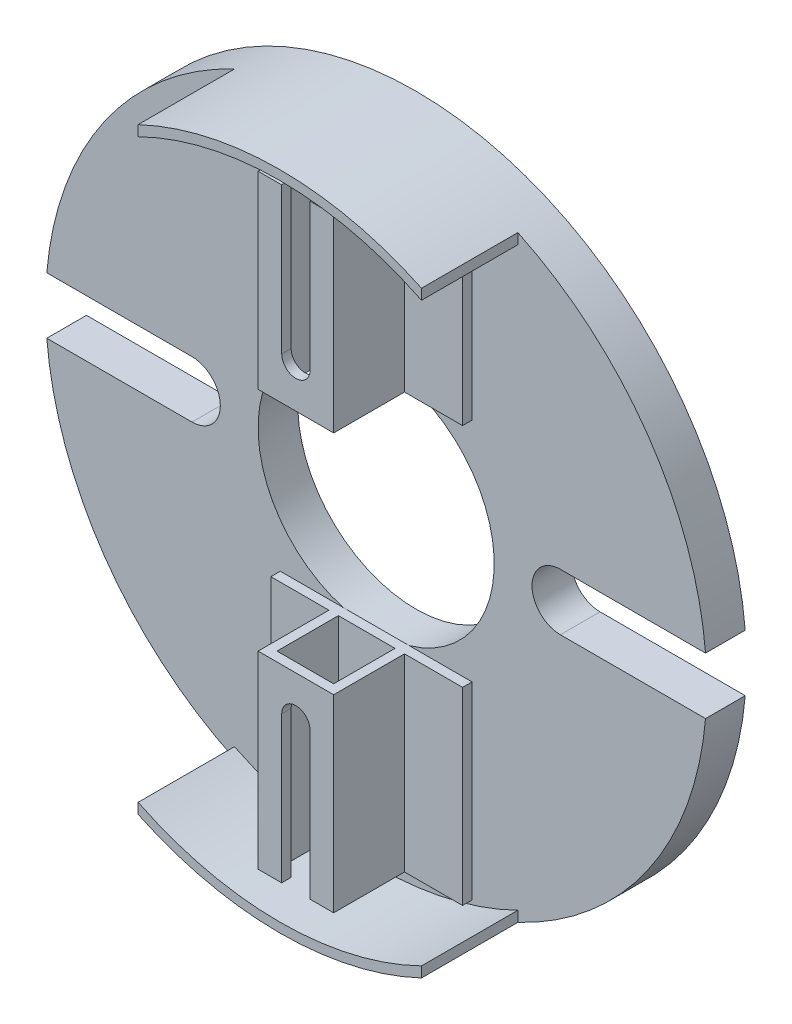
ISO-10303-21;
HEADER;
FILE_DESCRIPTION(('STEP AP214'),'2;1');
FILE_NAME('part.step','',(''),(''),'','','');
FILE_SCHEMA(('AUTOMOTIVE_DESIGN { 1 0 10303 214 1 1 1 1 }'));
ENDSEC;
DATA;
#1=APPLICATION_CONTEXT('core data for automotive mechanical design processes');
#2=APPLICATION_PROTOCOL_DEFINITION('international standard','automotive_design',2000,#1);
#3=PRODUCT_CONTEXT('',#1,'mechanical');
#4=PRODUCT('Part','Part','',(#3));
#5=PRODUCT_RELATED_PRODUCT_CATEGORY('part','',(#4));
#6=PRODUCT_DEFINITION_FORMATION('','',#4);
#7=PRODUCT_DEFINITION_CONTEXT('part definition',#1,'design');
#8=PRODUCT_DEFINITION('design','',#6,#7);
#9=PRODUCT_DEFINITION_SHAPE('','',#8);
#10=(LENGTH_UNIT() NAMED_UNIT(*) SI_UNIT(.MILLI.,.METRE.));
#11=(NAMED_UNIT(*) PLANE_ANGLE_UNIT() SI_UNIT($,.RADIAN.));
#12=(NAMED_UNIT(*) SI_UNIT($,.STERADIAN.) SOLID_ANGLE_UNIT());
#13=UNCERTAINTY_MEASURE_WITH_UNIT(LENGTH_MEASURE(1.E-05),#10,'distance_accuracy_value','');
#14=(GEOMETRIC_REPRESENTATION_CONTEXT(3) GLOBAL_UNCERTAINTY_ASSIGNED_CONTEXT((#13)) GLOBAL_UNIT_ASSIGNED_CONTEXT((#10,
#11,#12)) REPRESENTATION_CONTEXT('',''));
#15=CARTESIAN_POINT('',(0.,0.,0.));
#16=DIRECTION('',(0.,0.,1.));
#17=DIRECTION('',(1.,0.,0.));
#18=AXIS2_PLACEMENT_3D('',#15,#16,#17);
#19=CARTESIAN_POINT('',(-19.5,-36.1,4.2));
#20=DIRECTION('',(0.,0.,1.));
#21=DIRECTION('',(1.,0.,0.));
#22=AXIS2_PLACEMENT_3D('',#19,#20,#21);
#23=PLANE('',#22);
#24=DIRECTION('',(1.,0.,0.));
#25=VECTOR('',#24,1.);
#26=CARTESIAN_POINT('',(3.00000000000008,-48.1,4.2));
#27=LINE('',#26,#25);
#28=CARTESIAN_POINT('',(-10.1499999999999,-48.1000000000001,4.2));
#29=VERTEX_POINT('',#28);
#30=CARTESIAN_POINT('',(-3.49999999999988,-48.1,4.2));
#31=VERTEX_POINT('',#30);
#32=EDGE_CURVE('E1067',#29,#31,#27,.T.);
#33=ORIENTED_EDGE('',*,*,#32,.T.);
#34=CARTESIAN_POINT('',(0.,-36.1,4.2));
#35=DIRECTION('',(0.,0.,1.));
#36=DIRECTION('',(1.,0.,0.));
#37=AXIS2_PLACEMENT_3D('',#34,#35,#36);
#38=CIRCLE('',#37,12.5);
#39=CARTESIAN_POINT('',(-3.5,-24.1,4.2));
#40=VERTEX_POINT('',#39);
#41=EDGE_CURVE('E612',#40,#31,#38,.T.);
#42=ORIENTED_EDGE('',*,*,#41,.F.);
#43=DIRECTION('',(-1.,0.,0.));
#44=VECTOR('',#43,1.);
#45=CARTESIAN_POINT('',(-3.,-24.1,4.2));
#46=LINE('',#45,#44);
#47=CARTESIAN_POINT('',(-10.15,-24.1,4.2));
#48=VERTEX_POINT('',#47);
#49=EDGE_CURVE('E506',#40,#48,#46,.T.);
#50=ORIENTED_EDGE('',*,*,#49,.T.);
#51=DIRECTION('',(0.,-1.,0.));
#52=VECTOR('',#51,1.);
#53=CARTESIAN_POINT('',(-10.15,-4.1,4.2));
#54=LINE('',#53,#52);
#55=CARTESIAN_POINT('',(-10.15,-4.1,4.2));
#56=VERTEX_POINT('',#55);
#57=EDGE_CURVE('E550',#56,#48,#54,.T.);
#58=ORIENTED_EDGE('',*,*,#57,.F.);
#59=DIRECTION('',(-1.,0.,0.));
#60=VECTOR('',#59,1.);
#61=CARTESIAN_POINT('',(10.15,-4.1,4.2));
#62=LINE('',#61,#60);
#63=CARTESIAN_POINT('',(10.15,-4.1,4.2));
#64=VERTEX_POINT('',#63);
#65=EDGE_CURVE('E526',#64,#56,#62,.T.);
#66=ORIENTED_EDGE('',*,*,#65,.F.);
#67=DIRECTION('',(0.,-1.,0.));
#68=VECTOR('',#67,1.);
#69=CARTESIAN_POINT('',(10.15,-4.1,4.2));
#70=LINE('',#69,#68);
#71=CARTESIAN_POINT('',(10.15,-24.1,4.2));
#72=VERTEX_POINT('',#71);
#73=EDGE_CURVE('E552',#64,#72,#70,.T.);
#74=ORIENTED_EDGE('',*,*,#73,.T.);
#75=CARTESIAN_POINT('',(3.50000000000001,-24.1,4.2));
#76=VERTEX_POINT('',#75);
#77=EDGE_CURVE('E507',#72,#76,#46,.T.);
#78=ORIENTED_EDGE('',*,*,#77,.T.);
#79=CARTESIAN_POINT('',(3.50000000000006,-48.1,4.2));
#80=VERTEX_POINT('',#79);
#81=EDGE_CURVE('E607',#80,#76,#38,.T.);
#82=ORIENTED_EDGE('',*,*,#81,.F.);
#83=CARTESIAN_POINT('',(10.1500000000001,-48.1,4.2));
#84=VERTEX_POINT('',#83);
#85=EDGE_CURVE('E1066',#80,#84,#27,.T.);
#86=ORIENTED_EDGE('',*,*,#85,.T.);
#87=DIRECTION('',(0.,1.,0.));
#88=VECTOR('',#87,1.);
#89=CARTESIAN_POINT('',(10.1500000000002,-68.1,4.2));
#90=LINE('',#89,#88);
#91=CARTESIAN_POINT('',(10.1500000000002,-68.1,4.2));
#92=VERTEX_POINT('',#91);
#93=EDGE_CURVE('E398',#92,#84,#90,.T.);
#94=ORIENTED_EDGE('',*,*,#93,.F.);
#95=DIRECTION('',(1.,0.,0.));
#96=VECTOR('',#95,1.);
#97=CARTESIAN_POINT('',(-10.1499999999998,-68.1000000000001,4.2));
#98=LINE('',#97,#96);
#99=CARTESIAN_POINT('',(-10.1499999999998,-68.1000000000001,4.2));
#100=VERTEX_POINT('',#99);
#101=EDGE_CURVE('E1084',#100,#92,#98,.T.);
#102=ORIENTED_EDGE('',*,*,#101,.F.);
#103=DIRECTION('',(0.,1.,0.));
#104=VECTOR('',#103,1.);
#105=CARTESIAN_POINT('',(-10.1499999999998,-68.1000000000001,4.2));
#106=LINE('',#105,#104);
#107=EDGE_CURVE('E400',#100,#29,#106,.T.);
#108=ORIENTED_EDGE('',*,*,#107,.T.);
#109=EDGE_LOOP('',(#33,#42,#50,#58,#66,#74,#78,#82,#86,#94,#102,#108));
#110=FACE_BOUND('',#109,.T.);
#111=CARTESIAN_POINT('',(0.,-36.1,4.2));
#112=DIRECTION('',(0.,0.,1.));
#113=DIRECTION('',(1.,0.,0.));
#114=AXIS2_PLACEMENT_3D('',#111,#112,#113);
#115=CIRCLE('',#114,35.);
#116=CARTESIAN_POINT('',(-34.8711915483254,-39.1,4.2));
#117=VERTEX_POINT('',#116);
#118=CARTESIAN_POINT('',(-14.9999999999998,-67.7227766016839,4.2));
#119=VERTEX_POINT('',#118);
#120=EDGE_CURVE('E635',#117,#119,#115,.T.);
#121=ORIENTED_EDGE('',*,*,#120,.T.);
#122=DIRECTION('',(0.,-1.,0.));
#123=VECTOR('',#122,1.);
#124=CARTESIAN_POINT('',(-14.9999999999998,-67.7227766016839,4.2));
#125=LINE('',#124,#123);
#126=CARTESIAN_POINT('',(-14.9999999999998,-66.6122926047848,4.2));
#127=VERTEX_POINT('',#126);
#128=EDGE_CURVE('E412',#127,#119,#125,.T.);
#129=ORIENTED_EDGE('',*,*,#128,.F.);
#130=CARTESIAN_POINT('',(0.,-36.1,4.2));
#131=DIRECTION('',(0.,0.,-1.));
#132=DIRECTION('',(-1.,0.,0.));
#133=AXIS2_PLACEMENT_3D('',#130,#131,#132);
#134=CIRCLE('',#133,34.);
#135=CARTESIAN_POINT('',(15.0000000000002,-66.6122926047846,4.2));
#136=VERTEX_POINT('',#135);
#137=EDGE_CURVE('E409',#136,#127,#134,.T.);
#138=ORIENTED_EDGE('',*,*,#137,.F.);
#139=DIRECTION('',(0.,1.,0.));
#140=VECTOR('',#139,1.);
#141=CARTESIAN_POINT('',(15.0000000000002,-67.7227766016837,4.2));
#142=LINE('',#141,#140);
#143=CARTESIAN_POINT('',(15.0000000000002,-67.7227766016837,4.2));
#144=VERTEX_POINT('',#143);
#145=EDGE_CURVE('E415',#144,#136,#142,.T.);
#146=ORIENTED_EDGE('',*,*,#145,.F.);
#147=CARTESIAN_POINT('',(34.8711915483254,-39.1,4.2));
#148=VERTEX_POINT('',#147);
#149=EDGE_CURVE('E634',#144,#148,#115,.T.);
#150=ORIENTED_EDGE('',*,*,#149,.T.);
#151=DIRECTION('',(-1.,0.,0.));
#152=VECTOR('',#151,1.);
#153=CARTESIAN_POINT('',(19.5,-39.1,4.2));
#154=LINE('',#153,#152);
#155=CARTESIAN_POINT('',(19.5,-39.1,4.2));
#156=VERTEX_POINT('',#155);
#157=EDGE_CURVE('E637',#148,#156,#154,.T.);
#158=ORIENTED_EDGE('',*,*,#157,.T.);
#159=CARTESIAN_POINT('',(19.5,-36.1,4.2));
#160=DIRECTION('',(0.,0.,-1.));
#161=DIRECTION('',(1.,0.,0.));
#162=AXIS2_PLACEMENT_3D('',#159,#160,#161);
#163=CIRCLE('',#162,3.00000000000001);
#164=CARTESIAN_POINT('',(19.5,-33.1,4.2));
#165=VERTEX_POINT('',#164);
#166=EDGE_CURVE('E639',#156,#165,#163,.T.);
#167=ORIENTED_EDGE('',*,*,#166,.T.);
#168=DIRECTION('',(1.,0.,0.));
#169=VECTOR('',#168,1.);
#170=CARTESIAN_POINT('',(19.5,-33.1,4.2));
#171=LINE('',#170,#169);
#172=CARTESIAN_POINT('',(34.8711915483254,-33.1,4.2));
#173=VERTEX_POINT('',#172);
#174=EDGE_CURVE('E641',#165,#173,#171,.T.);
#175=ORIENTED_EDGE('',*,*,#174,.T.);
#176=CARTESIAN_POINT('',(0.,-36.1,4.2));
#177=DIRECTION('',(0.,0.,1.));
#178=DIRECTION('',(1.,0.,0.));
#179=AXIS2_PLACEMENT_3D('',#176,#177,#178);
#180=CIRCLE('',#179,35.);
#181=CARTESIAN_POINT('',(15.,-4.4772233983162,4.2));
#182=VERTEX_POINT('',#181);
#183=EDGE_CURVE('E647',#173,#182,#180,.T.);
#184=ORIENTED_EDGE('',*,*,#183,.T.);
#185=DIRECTION('',(0.,1.,0.));
#186=VECTOR('',#185,1.);
#187=CARTESIAN_POINT('',(15.,-4.47722339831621,4.2));
#188=LINE('',#187,#186);
#189=CARTESIAN_POINT('',(15.,-5.58770739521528,4.2));
#190=VERTEX_POINT('',#189);
#191=EDGE_CURVE('E564',#190,#182,#188,.T.);
#192=ORIENTED_EDGE('',*,*,#191,.F.);
#193=CARTESIAN_POINT('',(0.,-36.1,4.2));
#194=DIRECTION('',(0.,0.,-1.));
#195=DIRECTION('',(1.,0.,0.));
#196=AXIS2_PLACEMENT_3D('',#193,#194,#195);
#197=CIRCLE('',#196,34.);
#198=CARTESIAN_POINT('',(-15.,-5.58770739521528,4.2));
#199=VERTEX_POINT('',#198);
#200=EDGE_CURVE('E561',#199,#190,#197,.T.);
#201=ORIENTED_EDGE('',*,*,#200,.F.);
#202=DIRECTION('',(0.,-1.,0.));
#203=VECTOR('',#202,1.);
#204=CARTESIAN_POINT('',(-15.,-4.4772233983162,4.2));
#205=LINE('',#204,#203);
#206=CARTESIAN_POINT('',(-15.,-4.4772233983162,4.2));
#207=VERTEX_POINT('',#206);
#208=EDGE_CURVE('E573',#207,#199,#205,.T.);
#209=ORIENTED_EDGE('',*,*,#208,.F.);
#210=CARTESIAN_POINT('',(-34.8711915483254,-33.1,4.2));
#211=VERTEX_POINT('',#210);
#212=EDGE_CURVE('E574',#207,#211,#180,.T.);
#213=ORIENTED_EDGE('',*,*,#212,.T.);
#214=DIRECTION('',(1.,0.,0.));
#215=VECTOR('',#214,1.);
#216=CARTESIAN_POINT('',(-34.8711915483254,-33.1,4.2));
#217=LINE('',#216,#215);
#218=CARTESIAN_POINT('',(-19.5,-33.1,4.2));
#219=VERTEX_POINT('',#218);
#220=EDGE_CURVE('E644',#211,#219,#217,.T.);
#221=ORIENTED_EDGE('',*,*,#220,.T.);
#222=CARTESIAN_POINT('',(-19.5,-36.1,4.2));
#223=DIRECTION('',(0.,0.,-1.));
#224=DIRECTION('',(1.,0.,0.));
#225=AXIS2_PLACEMENT_3D('',#222,#223,#224);
#226=CIRCLE('',#225,3.);
#227=CARTESIAN_POINT('',(-19.5,-39.1,4.2));
#228=VERTEX_POINT('',#227);
#229=EDGE_CURVE('E629',#219,#228,#226,.T.);
#230=ORIENTED_EDGE('',*,*,#229,.T.);
#231=DIRECTION('',(-1.,0.,0.));
#232=VECTOR('',#231,1.);
#233=CARTESIAN_POINT('',(-34.8711915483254,-39.1,4.2));
#234=LINE('',#233,#232);
#235=EDGE_CURVE('E632',#228,#117,#234,.T.);
#236=ORIENTED_EDGE('',*,*,#235,.T.);
#237=EDGE_LOOP('',(#121,#129,#138,#146,#150,#158,#167,#175,#184,#192,#201,#209,#213,#221,#230,#236));
#238=FACE_BOUND('',#237,.T.);
#239=ADVANCED_FACE('F36',(#110,#238),#23,.T.);
#240=CARTESIAN_POINT('',(-19.5,-36.1,0.));
#241=DIRECTION('',(0.,0.,1.));
#242=DIRECTION('',(1.,0.,0.));
#243=AXIS2_PLACEMENT_3D('',#240,#241,#242);
#244=PLANE('',#243);
#245=CARTESIAN_POINT('',(-19.5,-36.1,0.));
#246=DIRECTION('',(0.,0.,-1.));
#247=DIRECTION('',(1.,0.,0.));
#248=AXIS2_PLACEMENT_3D('',#245,#246,#247);
#249=CIRCLE('',#248,3.);
#250=CARTESIAN_POINT('',(-19.5,-33.1,0.));
#251=VERTEX_POINT('',#250);
#252=CARTESIAN_POINT('',(-19.5,-39.1,0.));
#253=VERTEX_POINT('',#252);
#254=EDGE_CURVE('E611',#251,#253,#249,.T.);
#255=ORIENTED_EDGE('',*,*,#254,.F.);
#256=DIRECTION('',(1.,0.,0.));
#257=VECTOR('',#256,1.);
#258=CARTESIAN_POINT('',(-34.8711915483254,-33.1,0.));
#259=LINE('',#258,#257);
#260=CARTESIAN_POINT('',(-34.8711915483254,-33.1,0.));
#261=VERTEX_POINT('',#260);
#262=EDGE_CURVE('E627',#261,#251,#259,.T.);
#263=ORIENTED_EDGE('',*,*,#262,.F.);
#264=CARTESIAN_POINT('',(0.,-36.1,0.));
#265=DIRECTION('',(0.,0.,1.));
#266=DIRECTION('',(1.,0.,0.));
#267=AXIS2_PLACEMENT_3D('',#264,#265,#266);
#268=CIRCLE('',#267,35.);
#269=CARTESIAN_POINT('',(34.8711915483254,-33.1,0.));
#270=VERTEX_POINT('',#269);
#271=EDGE_CURVE('E625',#270,#261,#268,.T.);
#272=ORIENTED_EDGE('',*,*,#271,.F.);
#273=DIRECTION('',(1.,0.,0.));
#274=VECTOR('',#273,1.);
#275=CARTESIAN_POINT('',(19.5,-33.1,0.));
#276=LINE('',#275,#274);
#277=CARTESIAN_POINT('',(19.5,-33.1,0.));
#278=VERTEX_POINT('',#277);
#279=EDGE_CURVE('E623',#278,#270,#276,.T.);
#280=ORIENTED_EDGE('',*,*,#279,.F.);
#281=CARTESIAN_POINT('',(19.5,-36.1,0.));
#282=DIRECTION('',(0.,0.,-1.));
#283=DIRECTION('',(1.,0.,0.));
#284=AXIS2_PLACEMENT_3D('',#281,#282,#283);
#285=CIRCLE('',#284,3.00000000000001);
#286=CARTESIAN_POINT('',(19.5,-39.1,0.));
#287=VERTEX_POINT('',#286);
#288=EDGE_CURVE('E621',#287,#278,#285,.T.);
#289=ORIENTED_EDGE('',*,*,#288,.F.);
#290=DIRECTION('',(-1.,0.,0.));
#291=VECTOR('',#290,1.);
#292=CARTESIAN_POINT('',(19.5,-39.1,0.));
#293=LINE('',#292,#291);
#294=CARTESIAN_POINT('',(34.8711915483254,-39.1,0.));
#295=VERTEX_POINT('',#294);
#296=EDGE_CURVE('E619',#295,#287,#293,.T.);
#297=ORIENTED_EDGE('',*,*,#296,.F.);
#298=CARTESIAN_POINT('',(0.,-36.1,0.));
#299=DIRECTION('',(0.,0.,1.));
#300=DIRECTION('',(1.,0.,0.));
#301=AXIS2_PLACEMENT_3D('',#298,#299,#300);
#302=CIRCLE('',#301,35.);
#303=CARTESIAN_POINT('',(-34.8711915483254,-39.1,0.));
#304=VERTEX_POINT('',#303);
#305=EDGE_CURVE('E617',#304,#295,#302,.T.);
#306=ORIENTED_EDGE('',*,*,#305,.F.);
#307=DIRECTION('',(-1.,0.,0.));
#308=VECTOR('',#307,1.);
#309=CARTESIAN_POINT('',(-34.8711915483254,-39.1,0.));
#310=LINE('',#309,#308);
#311=EDGE_CURVE('E615',#253,#304,#310,.T.);
#312=ORIENTED_EDGE('',*,*,#311,.F.);
#313=EDGE_LOOP('',(#255,#263,#272,#280,#289,#297,#306,#312));
#314=FACE_BOUND('',#313,.T.);
#315=CARTESIAN_POINT('',(0.,-36.1,0.));
#316=DIRECTION('',(0.,0.,1.));
#317=DIRECTION('',(1.,0.,0.));
#318=AXIS2_PLACEMENT_3D('',#315,#316,#317);
#319=CIRCLE('',#318,12.5);
#320=CARTESIAN_POINT('',(12.5,-36.1,0.));
#321=VERTEX_POINT('',#320);
#322=EDGE_CURVE('E604',#321,#321,#319,.T.);
#323=ORIENTED_EDGE('',*,*,#322,.T.);
#324=EDGE_LOOP('',(#323));
#325=FACE_BOUND('',#324,.T.);
#326=ADVANCED_FACE('F710',(#314,#325),#244,.F.);
#327=CARTESIAN_POINT('',(-19.5,-36.1,4.2));
#328=DIRECTION('',(0.,0.,-1.));
#329=DIRECTION('',(-1.,0.,0.));
#330=AXIS2_PLACEMENT_3D('',#327,#328,#329);
#331=CYLINDRICAL_SURFACE('',#330,3.);
#332=ORIENTED_EDGE('',*,*,#254,.T.);
#333=DIRECTION('',(0.,0.,-1.));
#334=VECTOR('',#333,1.);
#335=CARTESIAN_POINT('',(-19.5,-39.1,4.2));
#336=LINE('',#335,#334);
#337=EDGE_CURVE('E11',#228,#253,#336,.T.);
#338=ORIENTED_EDGE('',*,*,#337,.F.);
#339=ORIENTED_EDGE('',*,*,#229,.F.);
#340=DIRECTION('',(0.,0.,-1.));
#341=VECTOR('',#340,1.);
#342=CARTESIAN_POINT('',(-19.5,-33.1,4.2));
#343=LINE('',#342,#341);
#344=EDGE_CURVE('E665',#219,#251,#343,.T.);
#345=ORIENTED_EDGE('',*,*,#344,.T.);
#346=EDGE_LOOP('',(#332,#338,#339,#345));
#347=FACE_BOUND('',#346,.T.);
#348=ADVANCED_FACE('F38',(#347),#331,.F.);
#349=CARTESIAN_POINT('',(-34.8711915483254,-39.1,4.2));
#350=DIRECTION('',(0.,-1.,0.));
#351=DIRECTION('',(1.,0.,0.));
#352=AXIS2_PLACEMENT_3D('',#349,#350,#351);
#353=PLANE('',#352);
#354=ORIENTED_EDGE('',*,*,#311,.T.);
#355=DIRECTION('',(0.,0.,-1.));
#356=VECTOR('',#355,1.);
#357=CARTESIAN_POINT('',(-34.8711915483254,-39.1,4.2));
#358=LINE('',#357,#356);
#359=EDGE_CURVE('E45',#117,#304,#358,.T.);
#360=ORIENTED_EDGE('',*,*,#359,.F.);
#361=ORIENTED_EDGE('',*,*,#235,.F.);
#362=ORIENTED_EDGE('',*,*,#337,.T.);
#363=EDGE_LOOP('',(#354,#360,#361,#362));
#364=FACE_BOUND('',#363,.T.);
#365=ADVANCED_FACE('F680',(#364),#353,.F.);
#366=CARTESIAN_POINT('',(0.,-36.1,4.2));
#367=DIRECTION('',(0.,0.,-1.));
#368=DIRECTION('',(-1.,0.,0.));
#369=AXIS2_PLACEMENT_3D('',#366,#367,#368);
#370=CYLINDRICAL_SURFACE('',#369,35.);
#371=ORIENTED_EDGE('',*,*,#305,.T.);
#372=DIRECTION('',(0.,0.,-1.));
#373=VECTOR('',#372,1.);
#374=CARTESIAN_POINT('',(34.8711915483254,-39.1,4.2));
#375=LINE('',#374,#373);
#376=EDGE_CURVE('E651',#148,#295,#375,.T.);
#377=ORIENTED_EDGE('',*,*,#376,.F.);
#378=ORIENTED_EDGE('',*,*,#149,.F.);
#379=DIRECTION('',(0.,0.,-1.));
#380=VECTOR('',#379,1.);
#381=CARTESIAN_POINT('',(15.0000000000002,-67.7227766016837,14.4));
#382=LINE('',#381,#380);
#383=CARTESIAN_POINT('',(15.0000000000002,-67.7227766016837,14.4));
#384=VERTEX_POINT('',#383);
#385=EDGE_CURVE('E430',#384,#144,#382,.T.);
#386=ORIENTED_EDGE('',*,*,#385,.F.);
#387=CARTESIAN_POINT('',(0.,-36.1,14.4));
#388=DIRECTION('',(0.,0.,1.));
#389=DIRECTION('',(-1.,0.,0.));
#390=AXIS2_PLACEMENT_3D('',#387,#388,#389);
#391=CIRCLE('',#390,35.);
#392=CARTESIAN_POINT('',(-14.9999999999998,-67.7227766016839,14.4));
#393=VERTEX_POINT('',#392);
#394=EDGE_CURVE('E423',#393,#384,#391,.T.);
#395=ORIENTED_EDGE('',*,*,#394,.F.);
#396=DIRECTION('',(0.,0.,-1.));
#397=VECTOR('',#396,1.);
#398=CARTESIAN_POINT('',(-14.9999999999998,-67.7227766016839,14.4));
#399=LINE('',#398,#397);
#400=EDGE_CURVE('E433',#393,#119,#399,.T.);
#401=ORIENTED_EDGE('',*,*,#400,.T.);
#402=ORIENTED_EDGE('',*,*,#120,.F.);
#403=ORIENTED_EDGE('',*,*,#359,.T.);
#404=EDGE_LOOP('',(#371,#377,#378,#386,#395,#401,#402,#403));
#405=FACE_BOUND('',#404,.T.);
#406=ADVANCED_FACE('F689',(#405),#370,.T.);
#407=CARTESIAN_POINT('',(19.5,-39.1,4.2));
#408=DIRECTION('',(0.,-1.,0.));
#409=DIRECTION('',(1.,0.,0.));
#410=AXIS2_PLACEMENT_3D('',#407,#408,#409);
#411=PLANE('',#410);
#412=ORIENTED_EDGE('',*,*,#296,.T.);
#413=DIRECTION('',(0.,0.,-1.));
#414=VECTOR('',#413,1.);
#415=CARTESIAN_POINT('',(19.5,-39.1,4.2));
#416=LINE('',#415,#414);
#417=EDGE_CURVE('E654',#156,#287,#416,.T.);
#418=ORIENTED_EDGE('',*,*,#417,.F.);
#419=ORIENTED_EDGE('',*,*,#157,.F.);
#420=ORIENTED_EDGE('',*,*,#376,.T.);
#421=EDGE_LOOP('',(#412,#418,#419,#420));
#422=FACE_BOUND('',#421,.T.);
#423=ADVANCED_FACE('F735',(#422),#411,.F.);
#424=CARTESIAN_POINT('',(19.5,-36.1,4.2));
#425=DIRECTION('',(0.,0.,-1.));
#426=DIRECTION('',(-1.,0.,0.));
#427=AXIS2_PLACEMENT_3D('',#424,#425,#426);
#428=CYLINDRICAL_SURFACE('',#427,3.00000000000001);
#429=ORIENTED_EDGE('',*,*,#288,.T.);
#430=DIRECTION('',(0.,0.,-1.));
#431=VECTOR('',#430,1.);
#432=CARTESIAN_POINT('',(19.5,-33.1,4.2));
#433=LINE('',#432,#431);
#434=EDGE_CURVE('E657',#165,#278,#433,.T.);
#435=ORIENTED_EDGE('',*,*,#434,.F.);
#436=ORIENTED_EDGE('',*,*,#166,.F.);
#437=ORIENTED_EDGE('',*,*,#417,.T.);
#438=EDGE_LOOP('',(#429,#435,#436,#437));
#439=FACE_BOUND('',#438,.T.);
#440=ADVANCED_FACE('F731',(#439),#428,.F.);
#441=CARTESIAN_POINT('',(19.5,-33.1,4.2));
#442=DIRECTION('',(0.,1.,0.));
#443=DIRECTION('',(0.,0.,1.));
#444=AXIS2_PLACEMENT_3D('',#441,#442,#443);
#445=PLANE('',#444);
#446=ORIENTED_EDGE('',*,*,#279,.T.);
#447=DIRECTION('',(0.,0.,-1.));
#448=VECTOR('',#447,1.);
#449=CARTESIAN_POINT('',(34.8711915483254,-33.1,4.2));
#450=LINE('',#449,#448);
#451=EDGE_CURVE('E660',#173,#270,#450,.T.);
#452=ORIENTED_EDGE('',*,*,#451,.F.);
#453=ORIENTED_EDGE('',*,*,#174,.F.);
#454=ORIENTED_EDGE('',*,*,#434,.T.);
#455=EDGE_LOOP('',(#446,#452,#453,#454));
#456=FACE_BOUND('',#455,.T.);
#457=ADVANCED_FACE('F727',(#456),#445,.F.);
#458=CARTESIAN_POINT('',(0.,-36.1,4.2));
#459=DIRECTION('',(0.,0.,-1.));
#460=DIRECTION('',(-1.,0.,0.));
#461=AXIS2_PLACEMENT_3D('',#458,#459,#460);
#462=CYLINDRICAL_SURFACE('',#461,35.);
#463=ORIENTED_EDGE('',*,*,#271,.T.);
#464=DIRECTION('',(0.,0.,-1.));
#465=VECTOR('',#464,1.);
#466=CARTESIAN_POINT('',(-34.8711915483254,-33.1,4.2));
#467=LINE('',#466,#465);
#468=EDGE_CURVE('E663',#211,#261,#467,.T.);
#469=ORIENTED_EDGE('',*,*,#468,.F.);
#470=ORIENTED_EDGE('',*,*,#212,.F.);
#471=DIRECTION('',(0.,0.,-1.));
#472=VECTOR('',#471,1.);
#473=CARTESIAN_POINT('',(-15.,-4.4772233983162,14.4));
#474=LINE('',#473,#472);
#475=CARTESIAN_POINT('',(-15.,-4.4772233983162,14.4));
#476=VERTEX_POINT('',#475);
#477=EDGE_CURVE('E581',#476,#207,#474,.T.);
#478=ORIENTED_EDGE('',*,*,#477,.F.);
#479=CARTESIAN_POINT('',(0.,-36.1,14.4));
#480=DIRECTION('',(0.,0.,1.));
#481=DIRECTION('',(1.,0.,0.));
#482=AXIS2_PLACEMENT_3D('',#479,#480,#481);
#483=CIRCLE('',#482,35.);
#484=CARTESIAN_POINT('',(15.,-4.4772233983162,14.4));
#485=VERTEX_POINT('',#484);
#486=EDGE_CURVE('E598',#485,#476,#483,.T.);
#487=ORIENTED_EDGE('',*,*,#486,.F.);
#488=DIRECTION('',(0.,0.,-1.));
#489=VECTOR('',#488,1.);
#490=CARTESIAN_POINT('',(15.,-4.4772233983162,14.4));
#491=LINE('',#490,#489);
#492=EDGE_CURVE('E577',#485,#182,#491,.T.);
#493=ORIENTED_EDGE('',*,*,#492,.T.);
#494=ORIENTED_EDGE('',*,*,#183,.F.);
#495=ORIENTED_EDGE('',*,*,#451,.T.);
#496=EDGE_LOOP('',(#463,#469,#470,#478,#487,#493,#494,#495));
#497=FACE_BOUND('',#496,.T.);
#498=ADVANCED_FACE('F724',(#497),#462,.T.);
#499=CARTESIAN_POINT('',(-34.8711915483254,-33.1,4.2));
#500=DIRECTION('',(0.,1.,0.));
#501=DIRECTION('',(0.,0.,1.));
#502=AXIS2_PLACEMENT_3D('',#499,#500,#501);
#503=PLANE('',#502);
#504=ORIENTED_EDGE('',*,*,#262,.T.);
#505=ORIENTED_EDGE('',*,*,#344,.F.);
#506=ORIENTED_EDGE('',*,*,#220,.F.);
#507=ORIENTED_EDGE('',*,*,#468,.T.);
#508=EDGE_LOOP('',(#504,#505,#506,#507));
#509=FACE_BOUND('',#508,.T.);
#510=ADVANCED_FACE('F677',(#509),#503,.F.);
#511=CARTESIAN_POINT('',(0.,-36.1,4.2));
#512=DIRECTION('',(0.,0.,-1.));
#513=DIRECTION('',(-1.,0.,0.));
#514=AXIS2_PLACEMENT_3D('',#511,#512,#513);
#515=CYLINDRICAL_SURFACE('',#514,12.5);
#516=EDGE_CURVE('E608',#76,#40,#38,.T.);
#517=ORIENTED_EDGE('',*,*,#516,.T.);
#518=ORIENTED_EDGE('',*,*,#41,.T.);
#519=EDGE_CURVE('E1128',#31,#80,#38,.T.);
#520=ORIENTED_EDGE('',*,*,#519,.T.);
#521=ORIENTED_EDGE('',*,*,#81,.T.);
#522=EDGE_LOOP('',(#517,#518,#520,#521));
#523=FACE_BOUND('',#522,.T.);
#524=ORIENTED_EDGE('',*,*,#322,.F.);
#525=EDGE_LOOP('',(#524));
#526=FACE_BOUND('',#525,.T.);
#527=ADVANCED_FACE('F723',(#523,#526),#515,.F.);
#528=CARTESIAN_POINT('',(0.,-36.1,14.4));
#529=DIRECTION('',(0.,0.,-1.));
#530=DIRECTION('',(-1.,0.,0.));
#531=AXIS2_PLACEMENT_3D('',#528,#529,#530);
#532=CYLINDRICAL_SURFACE('',#531,34.);
#533=ORIENTED_EDGE('',*,*,#200,.T.);
#534=DIRECTION('',(0.,0.,-1.));
#535=VECTOR('',#534,1.);
#536=CARTESIAN_POINT('',(15.,-5.58770739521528,14.4));
#537=LINE('',#536,#535);
#538=CARTESIAN_POINT('',(15.,-5.58770739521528,14.4));
#539=VERTEX_POINT('',#538);
#540=EDGE_CURVE('E580',#539,#190,#537,.T.);
#541=ORIENTED_EDGE('',*,*,#540,.F.);
#542=CARTESIAN_POINT('',(0.,-36.1,14.4));
#543=DIRECTION('',(0.,0.,-1.));
#544=DIRECTION('',(1.,0.,0.));
#545=AXIS2_PLACEMENT_3D('',#542,#543,#544);
#546=CIRCLE('',#545,34.);
#547=CARTESIAN_POINT('',(-15.,-5.58770739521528,14.4));
#548=VERTEX_POINT('',#547);
#549=EDGE_CURVE('E567',#548,#539,#546,.T.);
#550=ORIENTED_EDGE('',*,*,#549,.F.);
#551=DIRECTION('',(0.,0.,-1.));
#552=VECTOR('',#551,1.);
#553=CARTESIAN_POINT('',(-15.,-5.58770739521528,14.4));
#554=LINE('',#553,#552);
#555=EDGE_CURVE('E588',#548,#199,#554,.T.);
#556=ORIENTED_EDGE('',*,*,#555,.T.);
#557=EDGE_LOOP('',(#533,#541,#550,#556));
#558=FACE_BOUND('',#557,.T.);
#559=ADVANCED_FACE('F803',(#558),#532,.F.);
#560=CARTESIAN_POINT('',(15.,-4.47722339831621,14.4));
#561=DIRECTION('',(-1.,0.,0.));
#562=DIRECTION('',(0.,0.,1.));
#563=AXIS2_PLACEMENT_3D('',#560,#561,#562);
#564=PLANE('',#563);
#565=ORIENTED_EDGE('',*,*,#191,.T.);
#566=ORIENTED_EDGE('',*,*,#492,.F.);
#567=DIRECTION('',(0.,1.,0.));
#568=VECTOR('',#567,1.);
#569=CARTESIAN_POINT('',(15.,-4.47722339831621,14.4));
#570=LINE('',#569,#568);
#571=EDGE_CURVE('E1257',#539,#485,#570,.T.);
#572=ORIENTED_EDGE('',*,*,#571,.F.);
#573=ORIENTED_EDGE('',*,*,#540,.T.);
#574=EDGE_LOOP('',(#565,#566,#572,#573));
#575=FACE_BOUND('',#574,.T.);
#576=ADVANCED_FACE('F1249',(#575),#564,.F.);
#577=CARTESIAN_POINT('',(-15.,-4.4772233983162,14.4));
#578=DIRECTION('',(1.,0.,0.));
#579=DIRECTION('',(0.,0.,-1.));
#580=AXIS2_PLACEMENT_3D('',#577,#578,#579);
#581=PLANE('',#580);
#582=ORIENTED_EDGE('',*,*,#208,.T.);
#583=ORIENTED_EDGE('',*,*,#555,.F.);
#584=DIRECTION('',(0.,-1.,0.));
#585=VECTOR('',#584,1.);
#586=CARTESIAN_POINT('',(-15.,-4.4772233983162,14.4));
#587=LINE('',#586,#585);
#588=EDGE_CURVE('E593',#476,#548,#587,.T.);
#589=ORIENTED_EDGE('',*,*,#588,.F.);
#590=ORIENTED_EDGE('',*,*,#477,.T.);
#591=EDGE_LOOP('',(#582,#583,#589,#590));
#592=FACE_BOUND('',#591,.T.);
#593=ADVANCED_FACE('F1245',(#592),#581,.F.);
#594=CARTESIAN_POINT('',(0.,-36.1,14.4));
#595=DIRECTION('',(0.,0.,1.));
#596=DIRECTION('',(1.,0.,0.));
#597=AXIS2_PLACEMENT_3D('',#594,#595,#596);
#598=PLANE('',#597);
#599=ORIENTED_EDGE('',*,*,#549,.T.);
#600=ORIENTED_EDGE('',*,*,#571,.T.);
#601=ORIENTED_EDGE('',*,*,#486,.T.);
#602=ORIENTED_EDGE('',*,*,#588,.T.);
#603=EDGE_LOOP('',(#599,#600,#601,#602));
#604=FACE_BOUND('',#603,.T.);
#605=ADVANCED_FACE('F1226',(#604),#598,.T.);
#606=CARTESIAN_POINT('',(4.,-4.1,5.2));
#607=DIRECTION('',(0.,-1.,0.));
#608=DIRECTION('',(0.,0.,-1.));
#609=AXIS2_PLACEMENT_3D('',#606,#607,#608);
#610=PLANE('',#609);
#611=DIRECTION('',(1.,0.,0.));
#612=VECTOR('',#611,1.);
#613=CARTESIAN_POINT('',(-4.,-4.1,12.7));
#614=LINE('',#613,#612);
#615=CARTESIAN_POINT('',(-4.,-4.1,12.7));
#616=VERTEX_POINT('',#615);
#617=CARTESIAN_POINT('',(-1.5,-4.1,12.7));
#618=VERTEX_POINT('',#617);
#619=EDGE_CURVE('E535',#616,#618,#614,.T.);
#620=ORIENTED_EDGE('',*,*,#619,.T.);
#621=DIRECTION('',(0.,0.,1.));
#622=VECTOR('',#621,1.);
#623=CARTESIAN_POINT('',(-1.5,-4.1,-0.000999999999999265));
#624=LINE('',#623,#622);
#625=CARTESIAN_POINT('',(-1.5,-4.1,11.7));
#626=VERTEX_POINT('',#625);
#627=EDGE_CURVE('E460',#626,#618,#624,.T.);
#628=ORIENTED_EDGE('',*,*,#627,.F.);
#629=DIRECTION('',(1.,0.,0.));
#630=VECTOR('',#629,1.);
#631=CARTESIAN_POINT('',(3.,-4.1,11.7));
#632=LINE('',#631,#630);
#633=CARTESIAN_POINT('',(-3.,-4.1,11.7));
#634=VERTEX_POINT('',#633);
#635=EDGE_CURVE('E478',#634,#626,#632,.T.);
#636=ORIENTED_EDGE('',*,*,#635,.F.);
#637=DIRECTION('',(0.,0.,1.));
#638=VECTOR('',#637,1.);
#639=CARTESIAN_POINT('',(-3.,-4.1,11.7));
#640=LINE('',#639,#638);
#641=CARTESIAN_POINT('',(-3.,-4.1,5.2));
#642=VERTEX_POINT('',#641);
#643=EDGE_CURVE('E486',#642,#634,#640,.T.);
#644=ORIENTED_EDGE('',*,*,#643,.F.);
#645=DIRECTION('',(-1.,0.,0.));
#646=VECTOR('',#645,1.);
#647=CARTESIAN_POINT('',(-3.,-4.1,5.2));
#648=LINE('',#647,#646);
#649=CARTESIAN_POINT('',(3.,-4.1,5.2));
#650=VERTEX_POINT('',#649);
#651=EDGE_CURVE('E483',#650,#642,#648,.T.);
#652=ORIENTED_EDGE('',*,*,#651,.F.);
#653=DIRECTION('',(0.,0.,-1.));
#654=VECTOR('',#653,1.);
#655=CARTESIAN_POINT('',(3.,-4.1,5.2));
#656=LINE('',#655,#654);
#657=CARTESIAN_POINT('',(3.,-4.1,11.7));
#658=VERTEX_POINT('',#657);
#659=EDGE_CURVE('E481',#658,#650,#656,.T.);
#660=ORIENTED_EDGE('',*,*,#659,.F.);
#661=CARTESIAN_POINT('',(1.5,-4.1,11.7));
#662=VERTEX_POINT('',#661);
#663=EDGE_CURVE('E477',#662,#658,#632,.T.);
#664=ORIENTED_EDGE('',*,*,#663,.F.);
#665=DIRECTION('',(0.,0.,1.));
#666=VECTOR('',#665,1.);
#667=CARTESIAN_POINT('',(1.5,-4.1,-0.000999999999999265));
#668=LINE('',#667,#666);
#669=CARTESIAN_POINT('',(1.5,-4.1,12.7));
#670=VERTEX_POINT('',#669);
#671=EDGE_CURVE('E444',#662,#670,#668,.T.);
#672=ORIENTED_EDGE('',*,*,#671,.T.);
#673=CARTESIAN_POINT('',(4.,-4.1,12.7));
#674=VERTEX_POINT('',#673);
#675=EDGE_CURVE('E534',#670,#674,#614,.T.);
#676=ORIENTED_EDGE('',*,*,#675,.T.);
#677=DIRECTION('',(0.,0.,-1.));
#678=VECTOR('',#677,1.);
#679=CARTESIAN_POINT('',(4.,-4.1,12.7));
#680=LINE('',#679,#678);
#681=CARTESIAN_POINT('',(4.,-4.1,5.2));
#682=VERTEX_POINT('',#681);
#683=EDGE_CURVE('E519',#674,#682,#680,.T.);
#684=ORIENTED_EDGE('',*,*,#683,.T.);
#685=DIRECTION('',(1.,0.,0.));
#686=VECTOR('',#685,1.);
#687=CARTESIAN_POINT('',(4.,-4.1,5.2));
#688=LINE('',#687,#686);
#689=CARTESIAN_POINT('',(10.15,-4.1,5.2));
#690=VERTEX_POINT('',#689);
#691=EDGE_CURVE('E522',#682,#690,#688,.T.);
#692=ORIENTED_EDGE('',*,*,#691,.T.);
#693=DIRECTION('',(0.,0.,-1.));
#694=VECTOR('',#693,1.);
#695=CARTESIAN_POINT('',(10.15,-4.1,5.2));
#696=LINE('',#695,#694);
#697=EDGE_CURVE('E524',#690,#64,#696,.T.);
#698=ORIENTED_EDGE('',*,*,#697,.T.);
#699=ORIENTED_EDGE('',*,*,#65,.T.);
#700=DIRECTION('',(0.,0.,1.));
#701=VECTOR('',#700,1.);
#702=CARTESIAN_POINT('',(-10.15,-4.1,4.2));
#703=LINE('',#702,#701);
#704=CARTESIAN_POINT('',(-10.15,-4.1,5.2));
#705=VERTEX_POINT('',#704);
#706=EDGE_CURVE('E528',#56,#705,#703,.T.);
#707=ORIENTED_EDGE('',*,*,#706,.T.);
#708=DIRECTION('',(1.,0.,0.));
#709=VECTOR('',#708,1.);
#710=CARTESIAN_POINT('',(-10.15,-4.1,5.2));
#711=LINE('',#710,#709);
#712=CARTESIAN_POINT('',(-4.,-4.1,5.2));
#713=VERTEX_POINT('',#712);
#714=EDGE_CURVE('E530',#705,#713,#711,.T.);
#715=ORIENTED_EDGE('',*,*,#714,.T.);
#716=DIRECTION('',(0.,0.,1.));
#717=VECTOR('',#716,1.);
#718=CARTESIAN_POINT('',(-4.,-4.1,5.2));
#719=LINE('',#718,#717);
#720=EDGE_CURVE('E532',#713,#616,#719,.T.);
#721=ORIENTED_EDGE('',*,*,#720,.T.);
#722=EDGE_LOOP('',(#620,#628,#636,#644,#652,#660,#664,#672,#676,#684,#692,#698,#699,#707,#715,#721));
#723=FACE_BOUND('',#722,.T.);
#724=ADVANCED_FACE('F1156',(#723),#610,.F.);
#725=CARTESIAN_POINT('',(4.,-24.1,5.2));
#726=DIRECTION('',(0.,-1.,0.));
#727=DIRECTION('',(0.,0.,-1.));
#728=AXIS2_PLACEMENT_3D('',#725,#726,#727);
#729=PLANE('',#728);
#730=DIRECTION('',(0.,0.,-1.));
#731=VECTOR('',#730,1.);
#732=CARTESIAN_POINT('',(4.,-24.1,12.7));
#733=LINE('',#732,#731);
#734=CARTESIAN_POINT('',(4.,-24.1,12.7));
#735=VERTEX_POINT('',#734);
#736=CARTESIAN_POINT('',(4.,-24.1,5.2));
#737=VERTEX_POINT('',#736);
#738=EDGE_CURVE('E498',#735,#737,#733,.T.);
#739=ORIENTED_EDGE('',*,*,#738,.F.);
#740=DIRECTION('',(1.,0.,0.));
#741=VECTOR('',#740,1.);
#742=CARTESIAN_POINT('',(-4.,-24.1,12.7));
#743=LINE('',#742,#741);
#744=CARTESIAN_POINT('',(-4.,-24.1,12.7));
#745=VERTEX_POINT('',#744);
#746=EDGE_CURVE('E517',#745,#735,#743,.T.);
#747=ORIENTED_EDGE('',*,*,#746,.F.);
#748=DIRECTION('',(0.,0.,1.));
#749=VECTOR('',#748,1.);
#750=CARTESIAN_POINT('',(-4.,-24.1,5.2));
#751=LINE('',#750,#749);
#752=CARTESIAN_POINT('',(-4.,-24.1,5.2));
#753=VERTEX_POINT('',#752);
#754=EDGE_CURVE('E515',#753,#745,#751,.T.);
#755=ORIENTED_EDGE('',*,*,#754,.F.);
#756=DIRECTION('',(1.,0.,0.));
#757=VECTOR('',#756,1.);
#758=CARTESIAN_POINT('',(-10.15,-24.1,5.2));
#759=LINE('',#758,#757);
#760=CARTESIAN_POINT('',(-10.15,-24.1,5.2));
#761=VERTEX_POINT('',#760);
#762=EDGE_CURVE('E513',#761,#753,#759,.T.);
#763=ORIENTED_EDGE('',*,*,#762,.F.);
#764=DIRECTION('',(0.,0.,1.));
#765=VECTOR('',#764,1.);
#766=CARTESIAN_POINT('',(-10.15,-24.1,4.2));
#767=LINE('',#766,#765);
#768=EDGE_CURVE('E510',#48,#761,#767,.T.);
#769=ORIENTED_EDGE('',*,*,#768,.F.);
#770=ORIENTED_EDGE('',*,*,#49,.F.);
#771=EDGE_CURVE('E511',#76,#40,#46,.T.);
#772=ORIENTED_EDGE('',*,*,#771,.F.);
#773=ORIENTED_EDGE('',*,*,#77,.F.);
#774=DIRECTION('',(0.,0.,-1.));
#775=VECTOR('',#774,1.);
#776=CARTESIAN_POINT('',(10.15,-24.1,5.2));
#777=LINE('',#776,#775);
#778=CARTESIAN_POINT('',(10.15,-24.1,5.2));
#779=VERTEX_POINT('',#778);
#780=EDGE_CURVE('E503',#779,#72,#777,.T.);
#781=ORIENTED_EDGE('',*,*,#780,.F.);
#782=DIRECTION('',(1.,0.,0.));
#783=VECTOR('',#782,1.);
#784=CARTESIAN_POINT('',(4.,-24.1,5.2));
#785=LINE('',#784,#783);
#786=EDGE_CURVE('E501',#737,#779,#785,.T.);
#787=ORIENTED_EDGE('',*,*,#786,.F.);
#788=EDGE_LOOP('',(#739,#747,#755,#763,#769,#770,#772,#773,#781,#787));
#789=FACE_BOUND('',#788,.T.);
#790=DIRECTION('',(0.,0.,1.));
#791=VECTOR('',#790,1.);
#792=CARTESIAN_POINT('',(-3.,-24.1,11.7));
#793=LINE('',#792,#791);
#794=CARTESIAN_POINT('',(-3.,-24.1,5.2));
#795=VERTEX_POINT('',#794);
#796=CARTESIAN_POINT('',(-3.,-24.1,11.7));
#797=VERTEX_POINT('',#796);
#798=EDGE_CURVE('E474',#795,#797,#793,.T.);
#799=ORIENTED_EDGE('',*,*,#798,.T.);
#800=DIRECTION('',(1.,0.,0.));
#801=VECTOR('',#800,1.);
#802=CARTESIAN_POINT('',(3.,-24.1,11.7));
#803=LINE('',#802,#801);
#804=CARTESIAN_POINT('',(3.,-24.1,11.7));
#805=VERTEX_POINT('',#804);
#806=EDGE_CURVE('E447',#797,#805,#803,.T.);
#807=ORIENTED_EDGE('',*,*,#806,.T.);
#808=DIRECTION('',(0.,0.,-1.));
#809=VECTOR('',#808,1.);
#810=CARTESIAN_POINT('',(3.,-24.1,5.2));
#811=LINE('',#810,#809);
#812=CARTESIAN_POINT('',(3.,-24.1,5.2));
#813=VERTEX_POINT('',#812);
#814=EDGE_CURVE('E468',#805,#813,#811,.T.);
#815=ORIENTED_EDGE('',*,*,#814,.T.);
#816=DIRECTION('',(-1.,0.,0.));
#817=VECTOR('',#816,1.);
#818=CARTESIAN_POINT('',(-3.,-24.1,5.2));
#819=LINE('',#818,#817);
#820=EDGE_CURVE('E471',#813,#795,#819,.T.);
#821=ORIENTED_EDGE('',*,*,#820,.T.);
#822=EDGE_LOOP('',(#799,#807,#815,#821));
#823=FACE_BOUND('',#822,.T.);
#824=ADVANCED_FACE('F1140',(#789,#823),#729,.T.);
#825=CARTESIAN_POINT('',(4.,-4.1,12.7));
#826=DIRECTION('',(-1.,0.,0.));
#827=DIRECTION('',(0.,0.,1.));
#828=AXIS2_PLACEMENT_3D('',#825,#826,#827);
#829=PLANE('',#828);
#830=ORIENTED_EDGE('',*,*,#738,.T.);
#831=DIRECTION('',(0.,-1.,0.));
#832=VECTOR('',#831,1.);
#833=CARTESIAN_POINT('',(4.,-4.1,5.2));
#834=LINE('',#833,#832);
#835=EDGE_CURVE('E558',#682,#737,#834,.T.);
#836=ORIENTED_EDGE('',*,*,#835,.F.);
#837=ORIENTED_EDGE('',*,*,#683,.F.);
#838=DIRECTION('',(0.,-1.,0.));
#839=VECTOR('',#838,1.);
#840=CARTESIAN_POINT('',(4.,-4.1,12.7));
#841=LINE('',#840,#839);
#842=EDGE_CURVE('E538',#674,#735,#841,.T.);
#843=ORIENTED_EDGE('',*,*,#842,.T.);
#844=EDGE_LOOP('',(#830,#836,#837,#843));
#845=FACE_BOUND('',#844,.T.);
#846=ADVANCED_FACE('F1170',(#845),#829,.F.);
#847=CARTESIAN_POINT('',(4.,-4.1,5.2));
#848=DIRECTION('',(0.,0.,-1.));
#849=DIRECTION('',(-1.,0.,0.));
#850=AXIS2_PLACEMENT_3D('',#847,#848,#849);
#851=PLANE('',#850);
#852=ORIENTED_EDGE('',*,*,#786,.T.);
#853=DIRECTION('',(0.,-1.,0.));
#854=VECTOR('',#853,1.);
#855=CARTESIAN_POINT('',(10.15,-4.1,5.2));
#856=LINE('',#855,#854);
#857=EDGE_CURVE('E555',#690,#779,#856,.T.);
#858=ORIENTED_EDGE('',*,*,#857,.F.);
#859=ORIENTED_EDGE('',*,*,#691,.F.);
#860=ORIENTED_EDGE('',*,*,#835,.T.);
#861=EDGE_LOOP('',(#852,#858,#859,#860));
#862=FACE_BOUND('',#861,.T.);
#863=ADVANCED_FACE('F1167',(#862),#851,.F.);
#864=CARTESIAN_POINT('',(10.15,-4.1,5.2));
#865=DIRECTION('',(-1.,0.,0.));
#866=DIRECTION('',(0.,0.,1.));
#867=AXIS2_PLACEMENT_3D('',#864,#865,#866);
#868=PLANE('',#867);
#869=ORIENTED_EDGE('',*,*,#780,.T.);
#870=ORIENTED_EDGE('',*,*,#73,.F.);
#871=ORIENTED_EDGE('',*,*,#697,.F.);
#872=ORIENTED_EDGE('',*,*,#857,.T.);
#873=EDGE_LOOP('',(#869,#870,#871,#872));
#874=FACE_BOUND('',#873,.T.);
#875=ADVANCED_FACE('F1162',(#874),#868,.F.);
#876=CARTESIAN_POINT('',(-3.,-4.1,4.2));
#877=DIRECTION('',(0.,0.,1.));
#878=DIRECTION('',(1.,0.,0.));
#879=AXIS2_PLACEMENT_3D('',#876,#877,#878);
#880=PLANE('',#879);
#881=ORIENTED_EDGE('',*,*,#516,.F.);
#882=ORIENTED_EDGE('',*,*,#771,.T.);
#883=EDGE_LOOP('',(#881,#882));
#884=FACE_BOUND('',#883,.T.);
#885=ADVANCED_FACE('F1137',(#884),#880,.F.);
#886=CARTESIAN_POINT('',(-10.15,-4.1,4.2));
#887=DIRECTION('',(1.,0.,0.));
#888=DIRECTION('',(0.,0.,-1.));
#889=AXIS2_PLACEMENT_3D('',#886,#887,#888);
#890=PLANE('',#889);
#891=ORIENTED_EDGE('',*,*,#768,.T.);
#892=DIRECTION('',(0.,-1.,0.));
#893=VECTOR('',#892,1.);
#894=CARTESIAN_POINT('',(-10.15,-4.1,5.2));
#895=LINE('',#894,#893);
#896=EDGE_CURVE('E547',#705,#761,#895,.T.);
#897=ORIENTED_EDGE('',*,*,#896,.F.);
#898=ORIENTED_EDGE('',*,*,#706,.F.);
#899=ORIENTED_EDGE('',*,*,#57,.T.);
#900=EDGE_LOOP('',(#891,#897,#898,#899));
#901=FACE_BOUND('',#900,.T.);
#902=ADVANCED_FACE('F1148',(#901),#890,.F.);
#903=CARTESIAN_POINT('',(-10.15,-4.1,5.2));
#904=DIRECTION('',(0.,0.,-1.));
#905=DIRECTION('',(-1.,0.,0.));
#906=AXIS2_PLACEMENT_3D('',#903,#904,#905);
#907=PLANE('',#906);
#908=ORIENTED_EDGE('',*,*,#762,.T.);
#909=DIRECTION('',(0.,-1.,0.));
#910=VECTOR('',#909,1.);
#911=CARTESIAN_POINT('',(-4.,-4.1,5.2));
#912=LINE('',#911,#910);
#913=EDGE_CURVE('E544',#713,#753,#912,.T.);
#914=ORIENTED_EDGE('',*,*,#913,.F.);
#915=ORIENTED_EDGE('',*,*,#714,.F.);
#916=ORIENTED_EDGE('',*,*,#896,.T.);
#917=EDGE_LOOP('',(#908,#914,#915,#916));
#918=FACE_BOUND('',#917,.T.);
#919=ADVANCED_FACE('F1152',(#918),#907,.F.);
#920=CARTESIAN_POINT('',(-4.,-4.1,5.2));
#921=DIRECTION('',(1.,0.,0.));
#922=DIRECTION('',(0.,0.,-1.));
#923=AXIS2_PLACEMENT_3D('',#920,#921,#922);
#924=PLANE('',#923);
#925=ORIENTED_EDGE('',*,*,#754,.T.);
#926=DIRECTION('',(0.,-1.,0.));
#927=VECTOR('',#926,1.);
#928=CARTESIAN_POINT('',(-4.,-4.1,12.7));
#929=LINE('',#928,#927);
#930=EDGE_CURVE('E541',#616,#745,#929,.T.);
#931=ORIENTED_EDGE('',*,*,#930,.F.);
#932=ORIENTED_EDGE('',*,*,#720,.F.);
#933=ORIENTED_EDGE('',*,*,#913,.T.);
#934=EDGE_LOOP('',(#925,#931,#932,#933));
#935=FACE_BOUND('',#934,.T.);
#936=ADVANCED_FACE('F1179',(#935),#924,.F.);
#937=CARTESIAN_POINT('',(-4.,-4.1,12.7));
#938=DIRECTION('',(0.,0.,-1.));
#939=DIRECTION('',(-1.,0.,0.));
#940=AXIS2_PLACEMENT_3D('',#937,#938,#939);
#941=PLANE('',#940);
#942=CARTESIAN_POINT('',(0.,-19.6,12.7));
#943=DIRECTION('',(0.,0.,1.));
#944=DIRECTION('',(1.,0.,0.));
#945=AXIS2_PLACEMENT_3D('',#942,#943,#944);
#946=CIRCLE('',#945,1.5);
#947=CARTESIAN_POINT('',(-1.5,-19.6,12.7));
#948=VERTEX_POINT('',#947);
#949=CARTESIAN_POINT('',(1.50000000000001,-19.6,12.7));
#950=VERTEX_POINT('',#949);
#951=EDGE_CURVE('E448',#948,#950,#946,.T.);
#952=ORIENTED_EDGE('',*,*,#951,.F.);
#953=DIRECTION('',(0.,-1.,0.));
#954=VECTOR('',#953,1.);
#955=CARTESIAN_POINT('',(-1.5,-4.1,12.7));
#956=LINE('',#955,#954);
#957=EDGE_CURVE('E451',#618,#948,#956,.T.);
#958=ORIENTED_EDGE('',*,*,#957,.F.);
#959=ORIENTED_EDGE('',*,*,#619,.F.);
#960=ORIENTED_EDGE('',*,*,#930,.T.);
#961=ORIENTED_EDGE('',*,*,#746,.T.);
#962=ORIENTED_EDGE('',*,*,#842,.F.);
#963=ORIENTED_EDGE('',*,*,#675,.F.);
#964=DIRECTION('',(0.,1.,0.));
#965=VECTOR('',#964,1.);
#966=CARTESIAN_POINT('',(1.5,-4.1,12.7));
#967=LINE('',#966,#965);
#968=EDGE_CURVE('E445',#950,#670,#967,.T.);
#969=ORIENTED_EDGE('',*,*,#968,.F.);
#970=EDGE_LOOP('',(#952,#958,#959,#960,#961,#962,#963,#969));
#971=FACE_BOUND('',#970,.T.);
#972=ADVANCED_FACE('F1175',(#971),#941,.F.);
#973=CARTESIAN_POINT('',(3.,-4.1,11.7));
#974=DIRECTION('',(0.,0.,-1.));
#975=DIRECTION('',(-1.,0.,0.));
#976=AXIS2_PLACEMENT_3D('',#973,#974,#975);
#977=PLANE('',#976);
#978=DIRECTION('',(0.,-1.,0.));
#979=VECTOR('',#978,1.);
#980=CARTESIAN_POINT('',(-1.5,-4.1,11.7));
#981=LINE('',#980,#979);
#982=CARTESIAN_POINT('',(-1.5,-19.6,11.7));
#983=VERTEX_POINT('',#982);
#984=EDGE_CURVE('E439',#626,#983,#981,.T.);
#985=ORIENTED_EDGE('',*,*,#984,.T.);
#986=CARTESIAN_POINT('',(0.,-19.6,11.7));
#987=DIRECTION('',(0.,0.,-1.));
#988=DIRECTION('',(-1.,0.,0.));
#989=AXIS2_PLACEMENT_3D('',#986,#987,#988);
#990=CIRCLE('',#989,1.5);
#991=CARTESIAN_POINT('',(1.5,-19.6,11.7));
#992=VERTEX_POINT('',#991);
#993=EDGE_CURVE('E440',#983,#992,#990,.F.);
#994=ORIENTED_EDGE('',*,*,#993,.T.);
#995=DIRECTION('',(0.,1.,0.));
#996=VECTOR('',#995,1.);
#997=CARTESIAN_POINT('',(1.5,-4.1,11.7));
#998=LINE('',#997,#996);
#999=EDGE_CURVE('E457',#992,#662,#998,.T.);
#1000=ORIENTED_EDGE('',*,*,#999,.T.);
#1001=ORIENTED_EDGE('',*,*,#663,.T.);
#1002=DIRECTION('',(0.,-1.,0.));
#1003=VECTOR('',#1002,1.);
#1004=CARTESIAN_POINT('',(3.,-4.1,11.7));
#1005=LINE('',#1004,#1003);
#1006=EDGE_CURVE('E495',#658,#805,#1005,.T.);
#1007=ORIENTED_EDGE('',*,*,#1006,.T.);
#1008=ORIENTED_EDGE('',*,*,#806,.F.);
#1009=DIRECTION('',(0.,-1.,0.));
#1010=VECTOR('',#1009,1.);
#1011=CARTESIAN_POINT('',(-3.,-4.1,11.7));
#1012=LINE('',#1011,#1010);
#1013=EDGE_CURVE('E488',#634,#797,#1012,.T.);
#1014=ORIENTED_EDGE('',*,*,#1013,.F.);
#1015=ORIENTED_EDGE('',*,*,#635,.T.);
#1016=EDGE_LOOP('',(#985,#994,#1000,#1001,#1007,#1008,#1014,#1015));
#1017=FACE_BOUND('',#1016,.T.);
#1018=ADVANCED_FACE('F1187',(#1017),#977,.T.);
#1019=CARTESIAN_POINT('',(3.,-4.1,5.2));
#1020=DIRECTION('',(-1.,0.,0.));
#1021=DIRECTION('',(0.,0.,1.));
#1022=AXIS2_PLACEMENT_3D('',#1019,#1020,#1021);
#1023=PLANE('',#1022);
#1024=ORIENTED_EDGE('',*,*,#814,.F.);
#1025=ORIENTED_EDGE('',*,*,#1006,.F.);
#1026=ORIENTED_EDGE('',*,*,#659,.T.);
#1027=DIRECTION('',(0.,-1.,0.));
#1028=VECTOR('',#1027,1.);
#1029=CARTESIAN_POINT('',(3.,-4.1,5.2));
#1030=LINE('',#1029,#1028);
#1031=EDGE_CURVE('E493',#650,#813,#1030,.T.);
#1032=ORIENTED_EDGE('',*,*,#1031,.T.);
#1033=EDGE_LOOP('',(#1024,#1025,#1026,#1032));
#1034=FACE_BOUND('',#1033,.T.);
#1035=ADVANCED_FACE('F1200',(#1034),#1023,.T.);
#1036=CARTESIAN_POINT('',(-3.,-4.1,5.2));
#1037=DIRECTION('',(0.,0.,1.));
#1038=DIRECTION('',(1.,0.,0.));
#1039=AXIS2_PLACEMENT_3D('',#1036,#1037,#1038);
#1040=PLANE('',#1039);
#1041=ORIENTED_EDGE('',*,*,#820,.F.);
#1042=ORIENTED_EDGE('',*,*,#1031,.F.);
#1043=ORIENTED_EDGE('',*,*,#651,.T.);
#1044=DIRECTION('',(0.,-1.,0.));
#1045=VECTOR('',#1044,1.);
#1046=CARTESIAN_POINT('',(-3.,-4.1,5.2));
#1047=LINE('',#1046,#1045);
#1048=EDGE_CURVE('E491',#642,#795,#1047,.T.);
#1049=ORIENTED_EDGE('',*,*,#1048,.T.);
#1050=EDGE_LOOP('',(#1041,#1042,#1043,#1049));
#1051=FACE_BOUND('',#1050,.T.);
#1052=ADVANCED_FACE('F1194',(#1051),#1040,.T.);
#1053=CARTESIAN_POINT('',(-3.,-4.1,11.7));
#1054=DIRECTION('',(1.,0.,0.));
#1055=DIRECTION('',(0.,0.,-1.));
#1056=AXIS2_PLACEMENT_3D('',#1053,#1054,#1055);
#1057=PLANE('',#1056);
#1058=ORIENTED_EDGE('',*,*,#798,.F.);
#1059=ORIENTED_EDGE('',*,*,#1048,.F.);
#1060=ORIENTED_EDGE('',*,*,#643,.T.);
#1061=ORIENTED_EDGE('',*,*,#1013,.T.);
#1062=EDGE_LOOP('',(#1058,#1059,#1060,#1061));
#1063=FACE_BOUND('',#1062,.T.);
#1064=ADVANCED_FACE('F1190',(#1063),#1057,.T.);
#1065=CARTESIAN_POINT('',(-1.5,-4.1,-0.000999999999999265));
#1066=DIRECTION('',(-1.,0.,0.));
#1067=DIRECTION('',(0.,-1.,0.));
#1068=AXIS2_PLACEMENT_3D('',#1065,#1066,#1067);
#1069=PLANE('',#1068);
#1070=ORIENTED_EDGE('',*,*,#627,.T.);
#1071=ORIENTED_EDGE('',*,*,#957,.T.);
#1072=DIRECTION('',(0.,0.,1.));
#1073=VECTOR('',#1072,1.);
#1074=CARTESIAN_POINT('',(-1.5,-19.6,-0.000999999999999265));
#1075=LINE('',#1074,#1073);
#1076=EDGE_CURVE('E456',#983,#948,#1075,.T.);
#1077=ORIENTED_EDGE('',*,*,#1076,.F.);
#1078=ORIENTED_EDGE('',*,*,#984,.F.);
#1079=EDGE_LOOP('',(#1070,#1071,#1077,#1078));
#1080=FACE_BOUND('',#1079,.T.);
#1081=ADVANCED_FACE('F1206',(#1080),#1069,.F.);
#1082=CARTESIAN_POINT('',(1.5,-4.1,-0.000999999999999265));
#1083=DIRECTION('',(1.,0.,0.));
#1084=DIRECTION('',(0.,1.,0.));
#1085=AXIS2_PLACEMENT_3D('',#1082,#1083,#1084);
#1086=PLANE('',#1085);
#1087=DIRECTION('',(0.,0.,1.));
#1088=VECTOR('',#1087,1.);
#1089=CARTESIAN_POINT('',(1.50000000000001,-19.6,-0.000999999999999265));
#1090=LINE('',#1089,#1088);
#1091=EDGE_CURVE('E443',#992,#950,#1090,.T.);
#1092=ORIENTED_EDGE('',*,*,#1091,.T.);
#1093=ORIENTED_EDGE('',*,*,#968,.T.);
#1094=ORIENTED_EDGE('',*,*,#671,.F.);
#1095=ORIENTED_EDGE('',*,*,#999,.F.);
#1096=EDGE_LOOP('',(#1092,#1093,#1094,#1095));
#1097=FACE_BOUND('',#1096,.T.);
#1098=ADVANCED_FACE('F1203',(#1097),#1086,.F.);
#1099=CARTESIAN_POINT('',(0.,-19.6,-0.000999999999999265));
#1100=DIRECTION('',(0.,0.,1.));
#1101=DIRECTION('',(1.,0.,0.));
#1102=AXIS2_PLACEMENT_3D('',#1099,#1100,#1101);
#1103=CYLINDRICAL_SURFACE('',#1102,1.5);
#1104=ORIENTED_EDGE('',*,*,#1076,.T.);
#1105=ORIENTED_EDGE('',*,*,#951,.T.);
#1106=ORIENTED_EDGE('',*,*,#1091,.F.);
#1107=ORIENTED_EDGE('',*,*,#993,.F.);
#1108=EDGE_LOOP('',(#1104,#1105,#1106,#1107));
#1109=FACE_BOUND('',#1108,.T.);
#1110=ADVANCED_FACE('F814',(#1109),#1103,.F.);
#1111=CARTESIAN_POINT('',(0.,-36.1,14.4));
#1112=DIRECTION('',(0.,0.,-1.));
#1113=DIRECTION('',(-1.,0.,0.));
#1114=AXIS2_PLACEMENT_3D('',#1111,#1112,#1113);
#1115=CYLINDRICAL_SURFACE('',#1114,34.);
#1116=ORIENTED_EDGE('',*,*,#137,.T.);
#1117=DIRECTION('',(0.,0.,-1.));
#1118=VECTOR('',#1117,1.);
#1119=CARTESIAN_POINT('',(-14.9999999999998,-66.6122926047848,14.4));
#1120=LINE('',#1119,#1118);
#1121=CARTESIAN_POINT('',(-14.9999999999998,-66.6122926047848,14.4));
#1122=VERTEX_POINT('',#1121);
#1123=EDGE_CURVE('E436',#1122,#127,#1120,.T.);
#1124=ORIENTED_EDGE('',*,*,#1123,.F.);
#1125=CARTESIAN_POINT('',(0.,-36.1,14.4));
#1126=DIRECTION('',(0.,0.,-1.));
#1127=DIRECTION('',(-1.,0.,0.));
#1128=AXIS2_PLACEMENT_3D('',#1125,#1126,#1127);
#1129=CIRCLE('',#1128,34.);
#1130=CARTESIAN_POINT('',(15.0000000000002,-66.6122926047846,14.4));
#1131=VERTEX_POINT('',#1130);
#1132=EDGE_CURVE('E418',#1131,#1122,#1129,.T.);
#1133=ORIENTED_EDGE('',*,*,#1132,.F.);
#1134=DIRECTION('',(0.,0.,-1.));
#1135=VECTOR('',#1134,1.);
#1136=CARTESIAN_POINT('',(15.0000000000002,-66.6122926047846,14.4));
#1137=LINE('',#1136,#1135);
#1138=EDGE_CURVE('E427',#1131,#136,#1137,.T.);
#1139=ORIENTED_EDGE('',*,*,#1138,.T.);
#1140=EDGE_LOOP('',(#1116,#1124,#1133,#1139));
#1141=FACE_BOUND('',#1140,.T.);
#1142=ADVANCED_FACE('F697',(#1141),#1115,.F.);
#1143=CARTESIAN_POINT('',(-14.9999999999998,-67.7227766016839,14.4));
#1144=DIRECTION('',(1.,0.,0.));
#1145=DIRECTION('',(0.,1.,0.));
#1146=AXIS2_PLACEMENT_3D('',#1143,#1144,#1145);
#1147=PLANE('',#1146);
#1148=ORIENTED_EDGE('',*,*,#128,.T.);
#1149=ORIENTED_EDGE('',*,*,#400,.F.);
#1150=DIRECTION('',(0.,-1.,0.));
#1151=VECTOR('',#1150,1.);
#1152=CARTESIAN_POINT('',(-14.9999999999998,-67.7227766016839,14.4));
#1153=LINE('',#1152,#1151);
#1154=EDGE_CURVE('E421',#1122,#393,#1153,.T.);
#1155=ORIENTED_EDGE('',*,*,#1154,.F.);
#1156=ORIENTED_EDGE('',*,*,#1123,.T.);
#1157=EDGE_LOOP('',(#1148,#1149,#1155,#1156));
#1158=FACE_BOUND('',#1157,.T.);
#1159=ADVANCED_FACE('F686',(#1158),#1147,.F.);
#1160=CARTESIAN_POINT('',(15.0000000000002,-67.7227766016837,14.4));
#1161=DIRECTION('',(-1.,0.,0.));
#1162=DIRECTION('',(0.,-1.,0.));
#1163=AXIS2_PLACEMENT_3D('',#1160,#1161,#1162);
#1164=PLANE('',#1163);
#1165=ORIENTED_EDGE('',*,*,#145,.T.);
#1166=ORIENTED_EDGE('',*,*,#1138,.F.);
#1167=DIRECTION('',(0.,1.,0.));
#1168=VECTOR('',#1167,1.);
#1169=CARTESIAN_POINT('',(15.0000000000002,-67.7227766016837,14.4));
#1170=LINE('',#1169,#1168);
#1171=EDGE_CURVE('E425',#384,#1131,#1170,.T.);
#1172=ORIENTED_EDGE('',*,*,#1171,.F.);
#1173=ORIENTED_EDGE('',*,*,#385,.T.);
#1174=EDGE_LOOP('',(#1165,#1166,#1172,#1173));
#1175=FACE_BOUND('',#1174,.T.);
#1176=ADVANCED_FACE('F700',(#1175),#1164,.F.);
#1177=CARTESIAN_POINT('',(0.,-36.1,14.4));
#1178=DIRECTION('',(0.,0.,1.));
#1179=DIRECTION('',(-1.,0.,0.));
#1180=AXIS2_PLACEMENT_3D('',#1177,#1178,#1179);
#1181=PLANE('',#1180);
#1182=ORIENTED_EDGE('',*,*,#1132,.T.);
#1183=ORIENTED_EDGE('',*,*,#1154,.T.);
#1184=ORIENTED_EDGE('',*,*,#394,.T.);
#1185=ORIENTED_EDGE('',*,*,#1171,.T.);
#1186=EDGE_LOOP('',(#1182,#1183,#1184,#1185));
#1187=FACE_BOUND('',#1186,.T.);
#1188=ADVANCED_FACE('F693',(#1187),#1181,.T.);
#1189=CARTESIAN_POINT('',(-3.99999999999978,-68.1000000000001,5.2));
#1190=DIRECTION('',(0.,1.,0.));
#1191=DIRECTION('',(0.,0.,-1.));
#1192=AXIS2_PLACEMENT_3D('',#1189,#1190,#1191);
#1193=PLANE('',#1192);
#1194=DIRECTION('',(-1.,0.,0.));
#1195=VECTOR('',#1194,1.);
#1196=CARTESIAN_POINT('',(4.00000000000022,-68.1,12.7));
#1197=LINE('',#1196,#1195);
#1198=CARTESIAN_POINT('',(4.00000000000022,-68.1,12.7));
#1199=VERTEX_POINT('',#1198);
#1200=CARTESIAN_POINT('',(1.50000000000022,-68.1,12.7));
#1201=VERTEX_POINT('',#1200);
#1202=EDGE_CURVE('E374',#1199,#1201,#1197,.T.);
#1203=ORIENTED_EDGE('',*,*,#1202,.T.);
#1204=DIRECTION('',(0.,0.,1.));
#1205=VECTOR('',#1204,1.);
#1206=CARTESIAN_POINT('',(1.50000000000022,-68.1,-0.00100000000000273));
#1207=LINE('',#1206,#1205);
#1208=CARTESIAN_POINT('',(1.50000000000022,-68.1,11.7));
#1209=VERTEX_POINT('',#1208);
#1210=EDGE_CURVE('E355',#1209,#1201,#1207,.T.);
#1211=ORIENTED_EDGE('',*,*,#1210,.F.);
#1212=DIRECTION('',(-1.,0.,0.));
#1213=VECTOR('',#1212,1.);
#1214=CARTESIAN_POINT('',(-2.99999999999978,-68.1,11.7));
#1215=LINE('',#1214,#1213);
#1216=CARTESIAN_POINT('',(3.00000000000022,-68.1,11.7));
#1217=VERTEX_POINT('',#1216);
#1218=EDGE_CURVE('E1039',#1217,#1209,#1215,.T.);
#1219=ORIENTED_EDGE('',*,*,#1218,.F.);
#1220=DIRECTION('',(0.,0.,1.));
#1221=VECTOR('',#1220,1.);
#1222=CARTESIAN_POINT('',(3.00000000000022,-68.1,11.7));
#1223=LINE('',#1222,#1221);
#1224=CARTESIAN_POINT('',(3.00000000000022,-68.1,5.2));
#1225=VERTEX_POINT('',#1224);
#1226=EDGE_CURVE('E1046',#1225,#1217,#1223,.T.);
#1227=ORIENTED_EDGE('',*,*,#1226,.F.);
#1228=DIRECTION('',(1.,0.,0.));
#1229=VECTOR('',#1228,1.);
#1230=CARTESIAN_POINT('',(3.00000000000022,-68.1,5.2));
#1231=LINE('',#1230,#1229);
#1232=CARTESIAN_POINT('',(-2.99999999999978,-68.1,5.2));
#1233=VERTEX_POINT('',#1232);
#1234=EDGE_CURVE('E1043',#1233,#1225,#1231,.T.);
#1235=ORIENTED_EDGE('',*,*,#1234,.F.);
#1236=DIRECTION('',(0.,0.,-1.));
#1237=VECTOR('',#1236,1.);
#1238=CARTESIAN_POINT('',(-2.99999999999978,-68.1,5.2));
#1239=LINE('',#1238,#1237);
#1240=CARTESIAN_POINT('',(-2.99999999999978,-68.1,11.7));
#1241=VERTEX_POINT('',#1240);
#1242=EDGE_CURVE('E1041',#1241,#1233,#1239,.T.);
#1243=ORIENTED_EDGE('',*,*,#1242,.F.);
#1244=CARTESIAN_POINT('',(-1.49999999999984,-68.1,11.7));
#1245=VERTEX_POINT('',#1244);
#1246=EDGE_CURVE('E1038',#1245,#1241,#1215,.T.);
#1247=ORIENTED_EDGE('',*,*,#1246,.F.);
#1248=DIRECTION('',(0.,0.,1.));
#1249=VECTOR('',#1248,1.);
#1250=CARTESIAN_POINT('',(-1.49999999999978,-68.1,-0.00100000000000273));
#1251=LINE('',#1250,#1249);
#1252=CARTESIAN_POINT('',(-1.49999999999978,-68.1,12.7));
#1253=VERTEX_POINT('',#1252);
#1254=EDGE_CURVE('E1104',#1245,#1253,#1251,.T.);
#1255=ORIENTED_EDGE('',*,*,#1254,.T.);
#1256=CARTESIAN_POINT('',(-3.99999999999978,-68.1000000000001,12.7));
#1257=VERTEX_POINT('',#1256);
#1258=EDGE_CURVE('E383',#1253,#1257,#1197,.T.);
#1259=ORIENTED_EDGE('',*,*,#1258,.T.);
#1260=DIRECTION('',(0.,0.,-1.));
#1261=VECTOR('',#1260,1.);
#1262=CARTESIAN_POINT('',(-3.99999999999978,-68.1000000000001,12.7));
#1263=LINE('',#1262,#1261);
#1264=CARTESIAN_POINT('',(-3.99999999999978,-68.1000000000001,5.2));
#1265=VERTEX_POINT('',#1264);
#1266=EDGE_CURVE('E1077',#1257,#1265,#1263,.T.);
#1267=ORIENTED_EDGE('',*,*,#1266,.T.);
#1268=DIRECTION('',(-1.,0.,0.));
#1269=VECTOR('',#1268,1.);
#1270=CARTESIAN_POINT('',(-3.99999999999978,-68.1000000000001,5.2));
#1271=LINE('',#1270,#1269);
#1272=CARTESIAN_POINT('',(-10.1499999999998,-68.1000000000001,5.2));
#1273=VERTEX_POINT('',#1272);
#1274=EDGE_CURVE('E1080',#1265,#1273,#1271,.T.);
#1275=ORIENTED_EDGE('',*,*,#1274,.T.);
#1276=DIRECTION('',(0.,0.,-1.));
#1277=VECTOR('',#1276,1.);
#1278=CARTESIAN_POINT('',(-10.1499999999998,-68.1000000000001,5.2));
#1279=LINE('',#1278,#1277);
#1280=EDGE_CURVE('E1082',#1273,#100,#1279,.T.);
#1281=ORIENTED_EDGE('',*,*,#1280,.T.);
#1282=ORIENTED_EDGE('',*,*,#101,.T.);
#1283=DIRECTION('',(0.,0.,1.));
#1284=VECTOR('',#1283,1.);
#1285=CARTESIAN_POINT('',(10.1500000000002,-68.1,4.2));
#1286=LINE('',#1285,#1284);
#1287=CARTESIAN_POINT('',(10.1500000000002,-68.1,5.2));
#1288=VERTEX_POINT('',#1287);
#1289=EDGE_CURVE('E1086',#92,#1288,#1286,.T.);
#1290=ORIENTED_EDGE('',*,*,#1289,.T.);
#1291=DIRECTION('',(-1.,0.,0.));
#1292=VECTOR('',#1291,1.);
#1293=CARTESIAN_POINT('',(10.1500000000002,-68.1,5.2));
#1294=LINE('',#1293,#1292);
#1295=CARTESIAN_POINT('',(4.00000000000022,-68.1,5.2));
#1296=VERTEX_POINT('',#1295);
#1297=EDGE_CURVE('E1087',#1288,#1296,#1294,.T.);
#1298=ORIENTED_EDGE('',*,*,#1297,.T.);
#1299=DIRECTION('',(0.,0.,1.));
#1300=VECTOR('',#1299,1.);
#1301=CARTESIAN_POINT('',(4.00000000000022,-68.1,5.2));
#1302=LINE('',#1301,#1300);
#1303=EDGE_CURVE('E380',#1296,#1199,#1302,.T.);
#1304=ORIENTED_EDGE('',*,*,#1303,.T.);
#1305=EDGE_LOOP('',(#1203,#1211,#1219,#1227,#1235,#1243,#1247,#1255,#1259,#1267,#1275,#1281,
#1282,#1290,#1298,#1304));
#1306=FACE_BOUND('',#1305,.T.);
#1307=ADVANCED_FACE('F378',(#1306),#1193,.F.);
#1308=CARTESIAN_POINT('',(-3.99999999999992,-48.1,5.2));
#1309=DIRECTION('',(0.,1.,0.));
#1310=DIRECTION('',(0.,0.,-1.));
#1311=AXIS2_PLACEMENT_3D('',#1308,#1309,#1310);
#1312=PLANE('',#1311);
#1313=DIRECTION('',(0.,0.,-1.));
#1314=VECTOR('',#1313,1.);
#1315=CARTESIAN_POINT('',(-3.99999999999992,-48.1,12.7));
#1316=LINE('',#1315,#1314);
#1317=CARTESIAN_POINT('',(-3.99999999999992,-48.1,12.7));
#1318=VERTEX_POINT('',#1317);
#1319=CARTESIAN_POINT('',(-3.99999999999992,-48.1,5.2));
#1320=VERTEX_POINT('',#1319);
#1321=EDGE_CURVE('E1058',#1318,#1320,#1316,.T.);
#1322=ORIENTED_EDGE('',*,*,#1321,.F.);
#1323=DIRECTION('',(-1.,0.,0.));
#1324=VECTOR('',#1323,1.);
#1325=CARTESIAN_POINT('',(4.00000000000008,-48.1,12.7));
#1326=LINE('',#1325,#1324);
#1327=CARTESIAN_POINT('',(4.00000000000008,-48.1,12.7));
#1328=VERTEX_POINT('',#1327);
#1329=EDGE_CURVE('E1075',#1328,#1318,#1326,.T.);
#1330=ORIENTED_EDGE('',*,*,#1329,.F.);
#1331=DIRECTION('',(0.,0.,1.));
#1332=VECTOR('',#1331,1.);
#1333=CARTESIAN_POINT('',(4.00000000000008,-48.1,5.2));
#1334=LINE('',#1333,#1332);
#1335=CARTESIAN_POINT('',(4.00000000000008,-48.1,5.2));
#1336=VERTEX_POINT('',#1335);
#1337=EDGE_CURVE('E1073',#1336,#1328,#1334,.T.);
#1338=ORIENTED_EDGE('',*,*,#1337,.F.);
#1339=DIRECTION('',(-1.,0.,0.));
#1340=VECTOR('',#1339,1.);
#1341=CARTESIAN_POINT('',(10.1500000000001,-48.1,5.2));
#1342=LINE('',#1341,#1340);
#1343=CARTESIAN_POINT('',(10.1500000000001,-48.1,5.2));
#1344=VERTEX_POINT('',#1343);
#1345=EDGE_CURVE('E1071',#1344,#1336,#1342,.T.);
#1346=ORIENTED_EDGE('',*,*,#1345,.F.);
#1347=DIRECTION('',(0.,0.,1.));
#1348=VECTOR('',#1347,1.);
#1349=CARTESIAN_POINT('',(10.1500000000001,-48.1,4.2));
#1350=LINE('',#1349,#1348);
#1351=EDGE_CURVE('E1069',#84,#1344,#1350,.T.);
#1352=ORIENTED_EDGE('',*,*,#1351,.F.);
#1353=ORIENTED_EDGE('',*,*,#85,.F.);
#1354=EDGE_CURVE('E60',#31,#80,#27,.T.);
#1355=ORIENTED_EDGE('',*,*,#1354,.F.);
#1356=ORIENTED_EDGE('',*,*,#32,.F.);
#1357=DIRECTION('',(0.,0.,-1.));
#1358=VECTOR('',#1357,1.);
#1359=CARTESIAN_POINT('',(-10.1499999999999,-48.1000000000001,5.2));
#1360=LINE('',#1359,#1358);
#1361=CARTESIAN_POINT('',(-10.1499999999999,-48.1000000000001,5.2));
#1362=VERTEX_POINT('',#1361);
#1363=EDGE_CURVE('E1063',#1362,#29,#1360,.T.);
#1364=ORIENTED_EDGE('',*,*,#1363,.F.);
#1365=DIRECTION('',(-1.,0.,0.));
#1366=VECTOR('',#1365,1.);
#1367=CARTESIAN_POINT('',(-3.99999999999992,-48.1,5.2));
#1368=LINE('',#1367,#1366);
#1369=EDGE_CURVE('E1061',#1320,#1362,#1368,.T.);
#1370=ORIENTED_EDGE('',*,*,#1369,.F.);
#1371=EDGE_LOOP('',(#1322,#1330,#1338,#1346,#1352,#1353,#1355,#1356,#1364,#1370));
#1372=FACE_BOUND('',#1371,.T.);
#1373=DIRECTION('',(0.,0.,1.));
#1374=VECTOR('',#1373,1.);
#1375=CARTESIAN_POINT('',(3.00000000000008,-48.1,11.7));
#1376=LINE('',#1375,#1374);
#1377=CARTESIAN_POINT('',(3.00000000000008,-48.1,5.2));
#1378=VERTEX_POINT('',#1377);
#1379=CARTESIAN_POINT('',(3.00000000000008,-48.1,11.7));
#1380=VERTEX_POINT('',#1379);
#1381=EDGE_CURVE('E1035',#1378,#1380,#1376,.T.);
#1382=ORIENTED_EDGE('',*,*,#1381,.T.);
#1383=DIRECTION('',(-1.,0.,0.));
#1384=VECTOR('',#1383,1.);
#1385=CARTESIAN_POINT('',(-2.99999999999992,-48.1,11.7));
#1386=LINE('',#1385,#1384);
#1387=CARTESIAN_POINT('',(-2.99999999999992,-48.1,11.7));
#1388=VERTEX_POINT('',#1387);
#1389=EDGE_CURVE('E1025',#1380,#1388,#1386,.T.);
#1390=ORIENTED_EDGE('',*,*,#1389,.T.);
#1391=DIRECTION('',(0.,0.,-1.));
#1392=VECTOR('',#1391,1.);
#1393=CARTESIAN_POINT('',(-2.99999999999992,-48.1,5.2));
#1394=LINE('',#1393,#1392);
#1395=CARTESIAN_POINT('',(-2.99999999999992,-48.1,5.2));
#1396=VERTEX_POINT('',#1395);
#1397=EDGE_CURVE('E1028',#1388,#1396,#1394,.T.);
#1398=ORIENTED_EDGE('',*,*,#1397,.T.);
#1399=DIRECTION('',(1.,0.,0.));
#1400=VECTOR('',#1399,1.);
#1401=CARTESIAN_POINT('',(3.00000000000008,-48.1,5.2));
#1402=LINE('',#1401,#1400);
#1403=EDGE_CURVE('E1032',#1396,#1378,#1402,.T.);
#1404=ORIENTED_EDGE('',*,*,#1403,.T.);
#1405=EDGE_LOOP('',(#1382,#1390,#1398,#1404));
#1406=FACE_BOUND('',#1405,.T.);
#1407=ADVANCED_FACE('F848',(#1372,#1406),#1312,.T.);
#1408=CARTESIAN_POINT('',(-3.99999999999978,-68.1000000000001,12.7));
#1409=DIRECTION('',(1.,0.,0.));
#1410=DIRECTION('',(0.,1.,0.));
#1411=AXIS2_PLACEMENT_3D('',#1408,#1409,#1410);
#1412=PLANE('',#1411);
#1413=ORIENTED_EDGE('',*,*,#1321,.T.);
#1414=DIRECTION('',(0.,1.,0.));
#1415=VECTOR('',#1414,1.);
#1416=CARTESIAN_POINT('',(-3.99999999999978,-68.1000000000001,5.2));
#1417=LINE('',#1416,#1415);
#1418=EDGE_CURVE('E406',#1265,#1320,#1417,.T.);
#1419=ORIENTED_EDGE('',*,*,#1418,.F.);
#1420=ORIENTED_EDGE('',*,*,#1266,.F.);
#1421=DIRECTION('',(0.,1.,0.));
#1422=VECTOR('',#1421,1.);
#1423=CARTESIAN_POINT('',(-3.99999999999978,-68.1000000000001,12.7));
#1424=LINE('',#1423,#1422);
#1425=EDGE_CURVE('E382',#1257,#1318,#1424,.T.);
#1426=ORIENTED_EDGE('',*,*,#1425,.T.);
#1427=EDGE_LOOP('',(#1413,#1419,#1420,#1426));
#1428=FACE_BOUND('',#1427,.T.);
#1429=ADVANCED_FACE('F858',(#1428),#1412,.F.);
#1430=CARTESIAN_POINT('',(-3.99999999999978,-68.1000000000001,5.2));
#1431=DIRECTION('',(0.,0.,-1.));
#1432=DIRECTION('',(-1.,0.,0.));
#1433=AXIS2_PLACEMENT_3D('',#1430,#1431,#1432);
#1434=PLANE('',#1433);
#1435=ORIENTED_EDGE('',*,*,#1369,.T.);
#1436=DIRECTION('',(0.,1.,0.));
#1437=VECTOR('',#1436,1.);
#1438=CARTESIAN_POINT('',(-10.1499999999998,-68.1000000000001,5.2));
#1439=LINE('',#1438,#1437);
#1440=EDGE_CURVE('E403',#1273,#1362,#1439,.T.);
#1441=ORIENTED_EDGE('',*,*,#1440,.F.);
#1442=ORIENTED_EDGE('',*,*,#1274,.F.);
#1443=ORIENTED_EDGE('',*,*,#1418,.T.);
#1444=EDGE_LOOP('',(#1435,#1441,#1442,#1443));
#1445=FACE_BOUND('',#1444,.T.);
#1446=ADVANCED_FACE('F870',(#1445),#1434,.F.);
#1447=CARTESIAN_POINT('',(-10.1499999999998,-68.1000000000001,5.2));
#1448=DIRECTION('',(1.,0.,0.));
#1449=DIRECTION('',(0.,1.,0.));
#1450=AXIS2_PLACEMENT_3D('',#1447,#1448,#1449);
#1451=PLANE('',#1450);
#1452=ORIENTED_EDGE('',*,*,#1363,.T.);
#1453=ORIENTED_EDGE('',*,*,#107,.F.);
#1454=ORIENTED_EDGE('',*,*,#1280,.F.);
#1455=ORIENTED_EDGE('',*,*,#1440,.T.);
#1456=EDGE_LOOP('',(#1452,#1453,#1454,#1455));
#1457=FACE_BOUND('',#1456,.T.);
#1458=ADVANCED_FACE('F881',(#1457),#1451,.F.);
#1459=CARTESIAN_POINT('',(3.00000000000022,-68.1,4.2));
#1460=DIRECTION('',(0.,0.,1.));
#1461=DIRECTION('',(1.,0.,0.));
#1462=AXIS2_PLACEMENT_3D('',#1459,#1460,#1461);
#1463=PLANE('',#1462);
#1464=ORIENTED_EDGE('',*,*,#519,.F.);
#1465=ORIENTED_EDGE('',*,*,#1354,.T.);
#1466=EDGE_LOOP('',(#1464,#1465));
#1467=FACE_BOUND('',#1466,.T.);
#1468=ADVANCED_FACE('F891',(#1467),#1463,.F.);
#1469=CARTESIAN_POINT('',(10.1500000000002,-68.1,4.2));
#1470=DIRECTION('',(-1.,0.,0.));
#1471=DIRECTION('',(0.,-1.,0.));
#1472=AXIS2_PLACEMENT_3D('',#1469,#1470,#1471);
#1473=PLANE('',#1472);
#1474=ORIENTED_EDGE('',*,*,#1351,.T.);
#1475=DIRECTION('',(0.,1.,0.));
#1476=VECTOR('',#1475,1.);
#1477=CARTESIAN_POINT('',(10.1500000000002,-68.1,5.2));
#1478=LINE('',#1477,#1476);
#1479=EDGE_CURVE('E395',#1288,#1344,#1478,.T.);
#1480=ORIENTED_EDGE('',*,*,#1479,.F.);
#1481=ORIENTED_EDGE('',*,*,#1289,.F.);
#1482=ORIENTED_EDGE('',*,*,#93,.T.);
#1483=EDGE_LOOP('',(#1474,#1480,#1481,#1482));
#1484=FACE_BOUND('',#1483,.T.);
#1485=ADVANCED_FACE('F902',(#1484),#1473,.F.);
#1486=CARTESIAN_POINT('',(10.1500000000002,-68.1,5.2));
#1487=DIRECTION('',(0.,0.,-1.));
#1488=DIRECTION('',(-1.,0.,0.));
#1489=AXIS2_PLACEMENT_3D('',#1486,#1487,#1488);
#1490=PLANE('',#1489);
#1491=ORIENTED_EDGE('',*,*,#1345,.T.);
#1492=DIRECTION('',(0.,1.,0.));
#1493=VECTOR('',#1492,1.);
#1494=CARTESIAN_POINT('',(4.00000000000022,-68.1,5.2));
#1495=LINE('',#1494,#1493);
#1496=EDGE_CURVE('E392',#1296,#1336,#1495,.T.);
#1497=ORIENTED_EDGE('',*,*,#1496,.F.);
#1498=ORIENTED_EDGE('',*,*,#1297,.F.);
#1499=ORIENTED_EDGE('',*,*,#1479,.T.);
#1500=EDGE_LOOP('',(#1491,#1497,#1498,#1499));
#1501=FACE_BOUND('',#1500,.T.);
#1502=ADVANCED_FACE('F911',(#1501),#1490,.F.);
#1503=CARTESIAN_POINT('',(4.00000000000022,-68.1,5.2));
#1504=DIRECTION('',(-1.,0.,0.));
#1505=DIRECTION('',(0.,-1.,0.));
#1506=AXIS2_PLACEMENT_3D('',#1503,#1504,#1505);
#1507=PLANE('',#1506);
#1508=ORIENTED_EDGE('',*,*,#1337,.T.);
#1509=DIRECTION('',(0.,1.,0.));
#1510=VECTOR('',#1509,1.);
#1511=CARTESIAN_POINT('',(4.00000000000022,-68.1,12.7));
#1512=LINE('',#1511,#1510);
#1513=EDGE_CURVE('E386',#1199,#1328,#1512,.T.);
#1514=ORIENTED_EDGE('',*,*,#1513,.F.);
#1515=ORIENTED_EDGE('',*,*,#1303,.F.);
#1516=ORIENTED_EDGE('',*,*,#1496,.T.);
#1517=EDGE_LOOP('',(#1508,#1514,#1515,#1516));
#1518=FACE_BOUND('',#1517,.T.);
#1519=ADVANCED_FACE('F922',(#1518),#1507,.F.);
#1520=CARTESIAN_POINT('',(4.00000000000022,-68.1,12.7));
#1521=DIRECTION('',(0.,0.,-1.));
#1522=DIRECTION('',(-1.,0.,0.));
#1523=AXIS2_PLACEMENT_3D('',#1520,#1521,#1522);
#1524=PLANE('',#1523);
#1525=CARTESIAN_POINT('',(1.0941248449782E-13,-52.6,12.7));
#1526=DIRECTION('',(0.,0.,1.));
#1527=DIRECTION('',(-1.,0.,0.));
#1528=AXIS2_PLACEMENT_3D('',#1525,#1526,#1527);
#1529=CIRCLE('',#1528,1.5);
#1530=CARTESIAN_POINT('',(1.50000000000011,-52.6,12.7));
#1531=VERTEX_POINT('',#1530);
#1532=CARTESIAN_POINT('',(-1.49999999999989,-52.6,12.7));
#1533=VERTEX_POINT('',#1532);
#1534=EDGE_CURVE('E376',#1531,#1533,#1529,.T.);
#1535=ORIENTED_EDGE('',*,*,#1534,.F.);
#1536=DIRECTION('',(0.,1.,0.));
#1537=VECTOR('',#1536,1.);
#1538=CARTESIAN_POINT('',(1.50000000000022,-68.1,12.7));
#1539=LINE('',#1538,#1537);
#1540=EDGE_CURVE('E359',#1201,#1531,#1539,.T.);
#1541=ORIENTED_EDGE('',*,*,#1540,.F.);
#1542=ORIENTED_EDGE('',*,*,#1202,.F.);
#1543=ORIENTED_EDGE('',*,*,#1513,.T.);
#1544=ORIENTED_EDGE('',*,*,#1329,.T.);
#1545=ORIENTED_EDGE('',*,*,#1425,.F.);
#1546=ORIENTED_EDGE('',*,*,#1258,.F.);
#1547=DIRECTION('',(0.,-1.,0.));
#1548=VECTOR('',#1547,1.);
#1549=CARTESIAN_POINT('',(-1.49999999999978,-68.1,12.7));
#1550=LINE('',#1549,#1548);
#1551=EDGE_CURVE('E1029',#1533,#1253,#1550,.T.);
#1552=ORIENTED_EDGE('',*,*,#1551,.F.);
#1553=EDGE_LOOP('',(#1535,#1541,#1542,#1543,#1544,#1545,#1546,#1552));
#1554=FACE_BOUND('',#1553,.T.);
#1555=ADVANCED_FACE('F372',(#1554),#1524,.F.);
#1556=CARTESIAN_POINT('',(-2.99999999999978,-68.1,11.7));
#1557=DIRECTION('',(0.,0.,-1.));
#1558=DIRECTION('',(-1.,0.,0.));
#1559=AXIS2_PLACEMENT_3D('',#1556,#1557,#1558);
#1560=PLANE('',#1559);
#1561=DIRECTION('',(0.,1.,0.));
#1562=VECTOR('',#1561,1.);
#1563=CARTESIAN_POINT('',(1.50000000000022,-68.1,11.7));
#1564=LINE('',#1563,#1562);
#1565=CARTESIAN_POINT('',(1.50000000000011,-52.6,11.7));
#1566=VERTEX_POINT('',#1565);
#1567=EDGE_CURVE('E362',#1209,#1566,#1564,.T.);
#1568=ORIENTED_EDGE('',*,*,#1567,.T.);
#1569=CARTESIAN_POINT('',(1.09301462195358E-13,-52.6,11.7));
#1570=DIRECTION('',(0.,0.,-1.));
#1571=DIRECTION('',(-1.,0.,0.));
#1572=AXIS2_PLACEMENT_3D('',#1569,#1570,#1571);
#1573=CIRCLE('',#1572,1.5);
#1574=CARTESIAN_POINT('',(-1.49999999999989,-52.6,11.7));
#1575=VERTEX_POINT('',#1574);
#1576=EDGE_CURVE('E1019',#1566,#1575,#1573,.F.);
#1577=ORIENTED_EDGE('',*,*,#1576,.T.);
#1578=DIRECTION('',(0.,-1.,0.));
#1579=VECTOR('',#1578,1.);
#1580=CARTESIAN_POINT('',(-1.49999999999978,-68.1,11.7));
#1581=LINE('',#1580,#1579);
#1582=EDGE_CURVE('E367',#1575,#1245,#1581,.T.);
#1583=ORIENTED_EDGE('',*,*,#1582,.T.);
#1584=ORIENTED_EDGE('',*,*,#1246,.T.);
#1585=DIRECTION('',(0.,1.,0.));
#1586=VECTOR('',#1585,1.);
#1587=CARTESIAN_POINT('',(-2.99999999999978,-68.1,11.7));
#1588=LINE('',#1587,#1586);
#1589=EDGE_CURVE('E1055',#1241,#1388,#1588,.T.);
#1590=ORIENTED_EDGE('',*,*,#1589,.T.);
#1591=ORIENTED_EDGE('',*,*,#1389,.F.);
#1592=DIRECTION('',(0.,1.,0.));
#1593=VECTOR('',#1592,1.);
#1594=CARTESIAN_POINT('',(3.00000000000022,-68.1,11.7));
#1595=LINE('',#1594,#1593);
#1596=EDGE_CURVE('E1048',#1217,#1380,#1595,.T.);
#1597=ORIENTED_EDGE('',*,*,#1596,.F.);
#1598=ORIENTED_EDGE('',*,*,#1218,.T.);
#1599=EDGE_LOOP('',(#1568,#1577,#1583,#1584,#1590,#1591,#1597,#1598));
#1600=FACE_BOUND('',#1599,.T.);
#1601=ADVANCED_FACE('F941',(#1600),#1560,.T.);
#1602=CARTESIAN_POINT('',(-2.99999999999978,-68.1,5.2));
#1603=DIRECTION('',(1.,0.,0.));
#1604=DIRECTION('',(0.,1.,0.));
#1605=AXIS2_PLACEMENT_3D('',#1602,#1603,#1604);
#1606=PLANE('',#1605);
#1607=ORIENTED_EDGE('',*,*,#1397,.F.);
#1608=ORIENTED_EDGE('',*,*,#1589,.F.);
#1609=ORIENTED_EDGE('',*,*,#1242,.T.);
#1610=DIRECTION('',(0.,1.,0.));
#1611=VECTOR('',#1610,1.);
#1612=CARTESIAN_POINT('',(-2.99999999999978,-68.1,5.2));
#1613=LINE('',#1612,#1611);
#1614=EDGE_CURVE('E1053',#1233,#1396,#1613,.T.);
#1615=ORIENTED_EDGE('',*,*,#1614,.T.);
#1616=EDGE_LOOP('',(#1607,#1608,#1609,#1615));
#1617=FACE_BOUND('',#1616,.T.);
#1618=ADVANCED_FACE('F951',(#1617),#1606,.T.);
#1619=CARTESIAN_POINT('',(3.00000000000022,-68.1,5.2));
#1620=DIRECTION('',(0.,0.,1.));
#1621=DIRECTION('',(1.,0.,0.));
#1622=AXIS2_PLACEMENT_3D('',#1619,#1620,#1621);
#1623=PLANE('',#1622);
#1624=ORIENTED_EDGE('',*,*,#1403,.F.);
#1625=ORIENTED_EDGE('',*,*,#1614,.F.);
#1626=ORIENTED_EDGE('',*,*,#1234,.T.);
#1627=DIRECTION('',(0.,1.,0.));
#1628=VECTOR('',#1627,1.);
#1629=CARTESIAN_POINT('',(3.00000000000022,-68.1,5.2));
#1630=LINE('',#1629,#1628);
#1631=EDGE_CURVE('E1051',#1225,#1378,#1630,.T.);
#1632=ORIENTED_EDGE('',*,*,#1631,.T.);
#1633=EDGE_LOOP('',(#1624,#1625,#1626,#1632));
#1634=FACE_BOUND('',#1633,.T.);
#1635=ADVANCED_FACE('F961',(#1634),#1623,.T.);
#1636=CARTESIAN_POINT('',(3.00000000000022,-68.1,11.7));
#1637=DIRECTION('',(-1.,0.,0.));
#1638=DIRECTION('',(0.,-1.,0.));
#1639=AXIS2_PLACEMENT_3D('',#1636,#1637,#1638);
#1640=PLANE('',#1639);
#1641=ORIENTED_EDGE('',*,*,#1381,.F.);
#1642=ORIENTED_EDGE('',*,*,#1631,.F.);
#1643=ORIENTED_EDGE('',*,*,#1226,.T.);
#1644=ORIENTED_EDGE('',*,*,#1596,.T.);
#1645=EDGE_LOOP('',(#1641,#1642,#1643,#1644));
#1646=FACE_BOUND('',#1645,.T.);
#1647=ADVANCED_FACE('F971',(#1646),#1640,.T.);
#1648=CARTESIAN_POINT('',(1.50000000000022,-68.1,-0.00100000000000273));
#1649=DIRECTION('',(1.,0.,0.));
#1650=DIRECTION('',(0.,1.,0.));
#1651=AXIS2_PLACEMENT_3D('',#1648,#1649,#1650);
#1652=PLANE('',#1651);
#1653=ORIENTED_EDGE('',*,*,#1210,.T.);
#1654=ORIENTED_EDGE('',*,*,#1540,.T.);
#1655=DIRECTION('',(0.,0.,1.));
#1656=VECTOR('',#1655,1.);
#1657=CARTESIAN_POINT('',(1.50000000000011,-52.6,-0.00100000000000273));
#1658=LINE('',#1657,#1656);
#1659=EDGE_CURVE('E368',#1566,#1531,#1658,.T.);
#1660=ORIENTED_EDGE('',*,*,#1659,.F.);
#1661=ORIENTED_EDGE('',*,*,#1567,.F.);
#1662=EDGE_LOOP('',(#1653,#1654,#1660,#1661));
#1663=FACE_BOUND('',#1662,.T.);
#1664=ADVANCED_FACE('F357',(#1663),#1652,.F.);
#1665=CARTESIAN_POINT('',(-1.49999999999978,-68.1,-0.00100000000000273));
#1666=DIRECTION('',(-1.,0.,0.));
#1667=DIRECTION('',(0.,-1.,0.));
#1668=AXIS2_PLACEMENT_3D('',#1665,#1666,#1667);
#1669=PLANE('',#1668);
#1670=DIRECTION('',(0.,0.,1.));
#1671=VECTOR('',#1670,1.);
#1672=CARTESIAN_POINT('',(-1.49999999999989,-52.6,-0.00100000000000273));
#1673=LINE('',#1672,#1671);
#1674=EDGE_CURVE('E53',#1575,#1533,#1673,.T.);
#1675=ORIENTED_EDGE('',*,*,#1674,.T.);
#1676=ORIENTED_EDGE('',*,*,#1551,.T.);
#1677=ORIENTED_EDGE('',*,*,#1254,.F.);
#1678=ORIENTED_EDGE('',*,*,#1582,.F.);
#1679=EDGE_LOOP('',(#1675,#1676,#1677,#1678));
#1680=FACE_BOUND('',#1679,.T.);
#1681=ADVANCED_FACE('F991',(#1680),#1669,.F.);
#1682=CARTESIAN_POINT('',(1.08002390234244E-13,-52.6,-0.00100000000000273));
#1683=DIRECTION('',(0.,0.,1.));
#1684=DIRECTION('',(1.,0.,0.));
#1685=AXIS2_PLACEMENT_3D('',#1682,#1683,#1684);
#1686=CYLINDRICAL_SURFACE('',#1685,1.5);
#1687=ORIENTED_EDGE('',*,*,#1659,.T.);
#1688=ORIENTED_EDGE('',*,*,#1534,.T.);
#1689=ORIENTED_EDGE('',*,*,#1674,.F.);
#1690=ORIENTED_EDGE('',*,*,#1576,.F.);
#1691=EDGE_LOOP('',(#1687,#1688,#1689,#1690));
#1692=FACE_BOUND('',#1691,.T.);
#1693=ADVANCED_FACE('F1002',(#1692),#1686,.F.);
#1694=CLOSED_SHELL('',(#239,#326,#348,#365,#406,#423,#440,#457,#498,#510,#527,#559,#576,#593,
#605,#724,#824,#846,#863,#875,#885,#902,#919,#936,#972,#1018,#1035,#1052,#1064,#1081,#1098,
#1110,#1142,#1159,#1176,#1188,#1307,#1407,#1429,#1446,#1458,#1468,#1485,#1502,#1519,#1555,#1601,
#1618,#1635,#1647,#1664,#1681,#1693));
#1695=MANIFOLD_SOLID_BREP('B2',#1694);
#1696=ADVANCED_BREP_SHAPE_REPRESENTATION('',(#18,#1695),#14);
#1697=SHAPE_DEFINITION_REPRESENTATION(#9,#1696);
ENDSEC;
END-ISO-10303-21;
